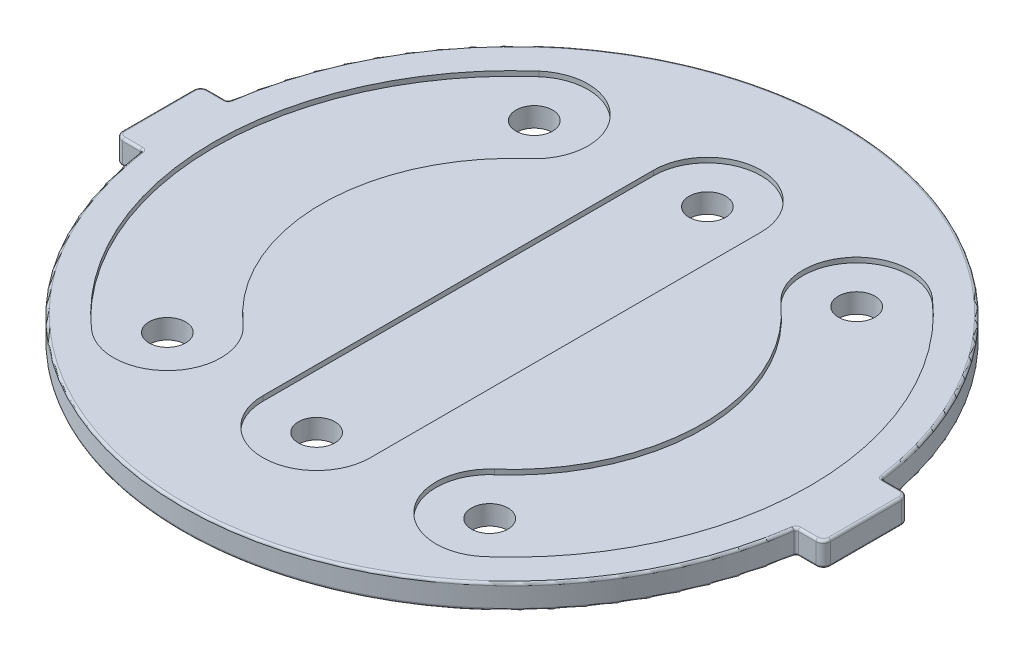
ISO-10303-21;
HEADER;
FILE_DESCRIPTION(('STEP AP214'),'2;1');
FILE_NAME('part.step','',(''),(''),'','','');
FILE_SCHEMA(('AUTOMOTIVE_DESIGN { 1 0 10303 214 1 1 1 1 }'));
ENDSEC;
DATA;
#1=APPLICATION_CONTEXT('core data for automotive mechanical design processes');
#2=APPLICATION_PROTOCOL_DEFINITION('international standard','automotive_design',2000,#1);
#3=PRODUCT_CONTEXT('',#1,'mechanical');
#4=PRODUCT('Part','Part','',(#3));
#5=PRODUCT_RELATED_PRODUCT_CATEGORY('part','',(#4));
#6=PRODUCT_DEFINITION_FORMATION('','',#4);
#7=PRODUCT_DEFINITION_CONTEXT('part definition',#1,'design');
#8=PRODUCT_DEFINITION('design','',#6,#7);
#9=PRODUCT_DEFINITION_SHAPE('','',#8);
#10=(LENGTH_UNIT() NAMED_UNIT(*) SI_UNIT(.MILLI.,.METRE.));
#11=(NAMED_UNIT(*) PLANE_ANGLE_UNIT() SI_UNIT($,.RADIAN.));
#12=(NAMED_UNIT(*) SI_UNIT($,.STERADIAN.) SOLID_ANGLE_UNIT());
#13=UNCERTAINTY_MEASURE_WITH_UNIT(LENGTH_MEASURE(1.E-05),#10,'distance_accuracy_value','');
#14=(GEOMETRIC_REPRESENTATION_CONTEXT(3) GLOBAL_UNCERTAINTY_ASSIGNED_CONTEXT((#13)) GLOBAL_UNIT_ASSIGNED_CONTEXT((#10,
#11,#12)) REPRESENTATION_CONTEXT('',''));
#15=CARTESIAN_POINT('',(0.,0.,0.));
#16=DIRECTION('',(0.,0.,1.));
#17=DIRECTION('',(1.,0.,0.));
#18=AXIS2_PLACEMENT_3D('',#15,#16,#17);
#19=CARTESIAN_POINT('',(65.9983145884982,10.,75.1280405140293));
#20=DIRECTION('',(0.,-1.,0.));
#21=DIRECTION('',(0.,0.,-1.));
#22=AXIS2_PLACEMENT_3D('',#19,#20,#21);
#23=CYLINDRICAL_SURFACE('',#22,7.5);
#24=CARTESIAN_POINT('',(65.9983145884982,0.,75.1280405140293));
#25=DIRECTION('',(0.,1.,0.));
#26=DIRECTION('',(0.,0.,1.));
#27=AXIS2_PLACEMENT_3D('',#24,#25,#26);
#28=CIRCLE('',#27,7.5);
#29=CARTESIAN_POINT('',(65.9983145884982,0.,82.6280405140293));
#30=VERTEX_POINT('',#29);
#31=EDGE_CURVE('E511',#30,#30,#28,.T.);
#32=ORIENTED_EDGE('',*,*,#31,.F.);
#33=EDGE_LOOP('',(#32));
#34=FACE_BOUND('',#33,.T.);
#35=CARTESIAN_POINT('',(65.9983145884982,8.,75.1280405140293));
#36=DIRECTION('',(0.,1.,0.));
#37=DIRECTION('',(0.,0.,1.));
#38=AXIS2_PLACEMENT_3D('',#35,#36,#37);
#39=CIRCLE('',#38,7.5);
#40=CARTESIAN_POINT('',(65.9983145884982,8.,82.6280405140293));
#41=VERTEX_POINT('',#40);
#42=EDGE_CURVE('E424',#41,#41,#39,.T.);
#43=ORIENTED_EDGE('',*,*,#42,.T.);
#44=EDGE_LOOP('',(#43));
#45=FACE_BOUND('',#44,.T.);
#46=ADVANCED_FACE('F104',(#34,#45),#23,.F.);
#47=CARTESIAN_POINT('',(65.9983145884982,10.,-75.1280405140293));
#48=DIRECTION('',(0.,-1.,0.));
#49=DIRECTION('',(0.,0.,-1.));
#50=AXIS2_PLACEMENT_3D('',#47,#48,#49);
#51=CYLINDRICAL_SURFACE('',#50,7.5);
#52=CARTESIAN_POINT('',(65.9983145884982,0.,-75.1280405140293));
#53=DIRECTION('',(0.,1.,0.));
#54=DIRECTION('',(0.,0.,1.));
#55=AXIS2_PLACEMENT_3D('',#52,#53,#54);
#56=CIRCLE('',#55,7.5);
#57=CARTESIAN_POINT('',(65.9983145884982,0.,-67.6280405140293));
#58=VERTEX_POINT('',#57);
#59=EDGE_CURVE('E514',#58,#58,#56,.T.);
#60=ORIENTED_EDGE('',*,*,#59,.F.);
#61=EDGE_LOOP('',(#60));
#62=FACE_BOUND('',#61,.T.);
#63=CARTESIAN_POINT('',(65.9983145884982,8.,-75.1280405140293));
#64=DIRECTION('',(0.,1.,0.));
#65=DIRECTION('',(0.,0.,1.));
#66=AXIS2_PLACEMENT_3D('',#63,#64,#65);
#67=CIRCLE('',#66,7.5);
#68=CARTESIAN_POINT('',(65.9983145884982,8.,-67.6280405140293));
#69=VERTEX_POINT('',#68);
#70=EDGE_CURVE('E108',#69,#69,#67,.T.);
#71=ORIENTED_EDGE('',*,*,#70,.T.);
#72=EDGE_LOOP('',(#71));
#73=FACE_BOUND('',#72,.T.);
#74=ADVANCED_FACE('F1038',(#62,#73),#51,.F.);
#75=CARTESIAN_POINT('',(-65.9983145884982,10.,75.1280405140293));
#76=DIRECTION('',(0.,-1.,0.));
#77=DIRECTION('',(0.,0.,-1.));
#78=AXIS2_PLACEMENT_3D('',#75,#76,#77);
#79=CYLINDRICAL_SURFACE('',#78,7.50000000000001);
#80=CARTESIAN_POINT('',(-65.9983145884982,0.,75.1280405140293));
#81=DIRECTION('',(0.,1.,0.));
#82=DIRECTION('',(0.,0.,1.));
#83=AXIS2_PLACEMENT_3D('',#80,#81,#82);
#84=CIRCLE('',#83,7.50000000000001);
#85=CARTESIAN_POINT('',(-65.9983145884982,0.,82.6280405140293));
#86=VERTEX_POINT('',#85);
#87=EDGE_CURVE('E498',#86,#86,#84,.T.);
#88=ORIENTED_EDGE('',*,*,#87,.F.);
#89=EDGE_LOOP('',(#88));
#90=FACE_BOUND('',#89,.T.);
#91=CARTESIAN_POINT('',(-65.9983145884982,8.,75.1280405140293));
#92=DIRECTION('',(0.,1.,0.));
#93=DIRECTION('',(0.,0.,1.));
#94=AXIS2_PLACEMENT_3D('',#91,#92,#93);
#95=CIRCLE('',#94,7.50000000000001);
#96=CARTESIAN_POINT('',(-65.9983145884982,8.,82.6280405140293));
#97=VERTEX_POINT('',#96);
#98=EDGE_CURVE('E458',#97,#97,#95,.T.);
#99=ORIENTED_EDGE('',*,*,#98,.T.);
#100=EDGE_LOOP('',(#99));
#101=FACE_BOUND('',#100,.T.);
#102=ADVANCED_FACE('F1044',(#90,#101),#79,.F.);
#103=CARTESIAN_POINT('',(-65.9983145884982,10.,-75.1280405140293));
#104=DIRECTION('',(0.,-1.,0.));
#105=DIRECTION('',(0.,0.,-1.));
#106=AXIS2_PLACEMENT_3D('',#103,#104,#105);
#107=CYLINDRICAL_SURFACE('',#106,7.50000000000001);
#108=CARTESIAN_POINT('',(-65.9983145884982,0.,-75.1280405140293));
#109=DIRECTION('',(0.,1.,0.));
#110=DIRECTION('',(0.,0.,1.));
#111=AXIS2_PLACEMENT_3D('',#108,#109,#110);
#112=CIRCLE('',#111,7.50000000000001);
#113=CARTESIAN_POINT('',(-65.9983145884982,0.,-67.6280405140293));
#114=VERTEX_POINT('',#113);
#115=EDGE_CURVE('E501',#114,#114,#112,.T.);
#116=ORIENTED_EDGE('',*,*,#115,.F.);
#117=EDGE_LOOP('',(#116));
#118=FACE_BOUND('',#117,.T.);
#119=CARTESIAN_POINT('',(-65.9983145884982,8.,-75.1280405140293));
#120=DIRECTION('',(0.,1.,0.));
#121=DIRECTION('',(0.,0.,1.));
#122=AXIS2_PLACEMENT_3D('',#119,#120,#121);
#123=CIRCLE('',#122,7.50000000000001);
#124=CARTESIAN_POINT('',(-65.9983145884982,8.,-67.6280405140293));
#125=VERTEX_POINT('',#124);
#126=EDGE_CURVE('E452',#125,#125,#123,.T.);
#127=ORIENTED_EDGE('',*,*,#126,.T.);
#128=EDGE_LOOP('',(#127));
#129=FACE_BOUND('',#128,.T.);
#130=ADVANCED_FACE('F788',(#118,#129),#107,.F.);
#131=CARTESIAN_POINT('',(0.,10.,-80.));
#132=DIRECTION('',(0.,-1.,0.));
#133=DIRECTION('',(0.,0.,-1.));
#134=AXIS2_PLACEMENT_3D('',#131,#132,#133);
#135=CYLINDRICAL_SURFACE('',#134,7.50000000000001);
#136=CARTESIAN_POINT('',(0.,0.,-80.));
#137=DIRECTION('',(0.,1.,0.));
#138=DIRECTION('',(0.,0.,1.));
#139=AXIS2_PLACEMENT_3D('',#136,#137,#138);
#140=CIRCLE('',#139,7.50000000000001);
#141=CARTESIAN_POINT('',(0.,0.,-72.5));
#142=VERTEX_POINT('',#141);
#143=EDGE_CURVE('E505',#142,#142,#140,.T.);
#144=ORIENTED_EDGE('',*,*,#143,.F.);
#145=EDGE_LOOP('',(#144));
#146=FACE_BOUND('',#145,.T.);
#147=CARTESIAN_POINT('',(0.,8.,-80.));
#148=DIRECTION('',(0.,1.,0.));
#149=DIRECTION('',(0.,0.,1.));
#150=AXIS2_PLACEMENT_3D('',#147,#148,#149);
#151=CIRCLE('',#150,7.50000000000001);
#152=CARTESIAN_POINT('',(0.,8.,-72.5));
#153=VERTEX_POINT('',#152);
#154=EDGE_CURVE('E494',#153,#153,#151,.T.);
#155=ORIENTED_EDGE('',*,*,#154,.T.);
#156=EDGE_LOOP('',(#155));
#157=FACE_BOUND('',#156,.T.);
#158=ADVANCED_FACE('F1053',(#146,#157),#135,.F.);
#159=CARTESIAN_POINT('',(0.,10.,80.));
#160=DIRECTION('',(0.,-1.,0.));
#161=DIRECTION('',(0.,0.,-1.));
#162=AXIS2_PLACEMENT_3D('',#159,#160,#161);
#163=CYLINDRICAL_SURFACE('',#162,7.50000000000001);
#164=CARTESIAN_POINT('',(0.,0.,80.));
#165=DIRECTION('',(0.,1.,0.));
#166=DIRECTION('',(0.,0.,1.));
#167=AXIS2_PLACEMENT_3D('',#164,#165,#166);
#168=CIRCLE('',#167,7.50000000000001);
#169=CARTESIAN_POINT('',(0.,0.,87.5));
#170=VERTEX_POINT('',#169);
#171=EDGE_CURVE('E508',#170,#170,#168,.T.);
#172=ORIENTED_EDGE('',*,*,#171,.F.);
#173=EDGE_LOOP('',(#172));
#174=FACE_BOUND('',#173,.T.);
#175=CARTESIAN_POINT('',(0.,8.,80.));
#176=DIRECTION('',(0.,1.,0.));
#177=DIRECTION('',(0.,0.,1.));
#178=AXIS2_PLACEMENT_3D('',#175,#176,#177);
#179=CIRCLE('',#178,7.50000000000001);
#180=CARTESIAN_POINT('',(0.,8.,87.5));
#181=VERTEX_POINT('',#180);
#182=EDGE_CURVE('E487',#181,#181,#179,.T.);
#183=ORIENTED_EDGE('',*,*,#182,.T.);
#184=EDGE_LOOP('',(#183));
#185=FACE_BOUND('',#184,.T.);
#186=ADVANCED_FACE('F1050',(#174,#185),#163,.F.);
#187=CARTESIAN_POINT('',(-297.141421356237,10.,-17.5));
#188=DIRECTION('',(0.,0.,1.));
#189=DIRECTION('',(1.,0.,0.));
#190=AXIS2_PLACEMENT_3D('',#187,#188,#189);
#191=PLANE('',#190);
#192=DIRECTION('',(0.,-1.,0.));
#193=VECTOR('',#192,1.);
#194=CARTESIAN_POINT('',(-142.,10.,-17.5));
#195=LINE('',#194,#193);
#196=CARTESIAN_POINT('',(-142.,0.999999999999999,-17.5));
#197=VERTEX_POINT('',#196);
#198=CARTESIAN_POINT('',(-142.,9.,-17.5));
#199=VERTEX_POINT('',#198);
#200=EDGE_CURVE('E523',#197,#199,#195,.F.);
#201=ORIENTED_EDGE('',*,*,#200,.T.);
#202=DIRECTION('',(-1.,0.,0.));
#203=VECTOR('',#202,1.);
#204=CARTESIAN_POINT('',(-134.735852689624,9.,-17.5));
#205=LINE('',#204,#203);
#206=CARTESIAN_POINT('',(-134.735852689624,9.,-17.5));
#207=VERTEX_POINT('',#206);
#208=EDGE_CURVE('E622',#199,#207,#205,.F.);
#209=ORIENTED_EDGE('',*,*,#208,.T.);
#210=DIRECTION('',(0.,1.,0.));
#211=VECTOR('',#210,1.);
#212=CARTESIAN_POINT('',(-134.735852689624,0.,-17.5));
#213=LINE('',#212,#211);
#214=CARTESIAN_POINT('',(-134.735852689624,0.999999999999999,-17.5));
#215=VERTEX_POINT('',#214);
#216=EDGE_CURVE('E541',#207,#215,#213,.F.);
#217=ORIENTED_EDGE('',*,*,#216,.T.);
#218=DIRECTION('',(-1.,0.,0.));
#219=VECTOR('',#218,1.);
#220=CARTESIAN_POINT('',(-297.141421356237,0.999999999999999,-17.5));
#221=LINE('',#220,#219);
#222=EDGE_CURVE('E620',#215,#197,#221,.T.);
#223=ORIENTED_EDGE('',*,*,#222,.T.);
#224=EDGE_LOOP('',(#201,#209,#217,#223));
#225=FACE_BOUND('',#224,.T.);
#226=ADVANCED_FACE('F1013',(#225),#191,.F.);
#227=CARTESIAN_POINT('',(-145.,10.,0.));
#228=DIRECTION('',(-1.,0.,0.));
#229=DIRECTION('',(0.,0.,1.));
#230=AXIS2_PLACEMENT_3D('',#227,#228,#229);
#231=PLANE('',#230);
#232=DIRECTION('',(0.,-1.,0.));
#233=VECTOR('',#232,1.);
#234=CARTESIAN_POINT('',(-145.,10.,14.5));
#235=LINE('',#234,#233);
#236=CARTESIAN_POINT('',(-145.,0.999999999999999,14.5));
#237=VERTEX_POINT('',#236);
#238=CARTESIAN_POINT('',(-145.,9.,14.5));
#239=VERTEX_POINT('',#238);
#240=EDGE_CURVE('E517',#237,#239,#235,.F.);
#241=ORIENTED_EDGE('',*,*,#240,.T.);
#242=DIRECTION('',(0.,0.,-1.));
#243=VECTOR('',#242,1.);
#244=CARTESIAN_POINT('',(-145.,9.,0.));
#245=LINE('',#244,#243);
#246=CARTESIAN_POINT('',(-145.,9.,-14.5));
#247=VERTEX_POINT('',#246);
#248=EDGE_CURVE('E614',#239,#247,#245,.T.);
#249=ORIENTED_EDGE('',*,*,#248,.T.);
#250=DIRECTION('',(0.,-1.,0.));
#251=VECTOR('',#250,1.);
#252=CARTESIAN_POINT('',(-145.,0.,-14.5));
#253=LINE('',#252,#251);
#254=CARTESIAN_POINT('',(-145.,0.999999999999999,-14.5));
#255=VERTEX_POINT('',#254);
#256=EDGE_CURVE('E520',#247,#255,#253,.T.);
#257=ORIENTED_EDGE('',*,*,#256,.T.);
#258=DIRECTION('',(0.,0.,-1.));
#259=VECTOR('',#258,1.);
#260=CARTESIAN_POINT('',(-145.,1.,14.5));
#261=LINE('',#260,#259);
#262=EDGE_CURVE('E612',#255,#237,#261,.F.);
#263=ORIENTED_EDGE('',*,*,#262,.T.);
#264=EDGE_LOOP('',(#241,#249,#257,#263));
#265=FACE_BOUND('',#264,.T.);
#266=ADVANCED_FACE('F908',(#265),#231,.T.);
#267=CARTESIAN_POINT('',(-297.141421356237,10.,17.5));
#268=DIRECTION('',(0.,0.,1.));
#269=DIRECTION('',(1.,0.,0.));
#270=AXIS2_PLACEMENT_3D('',#267,#268,#269);
#271=PLANE('',#270);
#272=DIRECTION('',(0.,-1.,0.));
#273=VECTOR('',#272,1.);
#274=CARTESIAN_POINT('',(-134.735852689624,10.,17.5));
#275=LINE('',#274,#273);
#276=CARTESIAN_POINT('',(-134.735852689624,0.999999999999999,17.5));
#277=VERTEX_POINT('',#276);
#278=CARTESIAN_POINT('',(-134.735852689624,9.,17.5));
#279=VERTEX_POINT('',#278);
#280=EDGE_CURVE('E556',#277,#279,#275,.F.);
#281=ORIENTED_EDGE('',*,*,#280,.T.);
#282=DIRECTION('',(-1.,0.,0.));
#283=VECTOR('',#282,1.);
#284=CARTESIAN_POINT('',(-297.141421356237,9.,17.5));
#285=LINE('',#284,#283);
#286=CARTESIAN_POINT('',(-142.,9.,17.5));
#287=VERTEX_POINT('',#286);
#288=EDGE_CURVE('E606',#279,#287,#285,.T.);
#289=ORIENTED_EDGE('',*,*,#288,.T.);
#290=DIRECTION('',(0.,-1.,0.));
#291=VECTOR('',#290,1.);
#292=CARTESIAN_POINT('',(-142.,10.,17.5));
#293=LINE('',#292,#291);
#294=CARTESIAN_POINT('',(-142.,0.999999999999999,17.5));
#295=VERTEX_POINT('',#294);
#296=EDGE_CURVE('E526',#287,#295,#293,.T.);
#297=ORIENTED_EDGE('',*,*,#296,.T.);
#298=DIRECTION('',(-1.,0.,0.));
#299=VECTOR('',#298,1.);
#300=CARTESIAN_POINT('',(-134.735852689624,1.,17.5));
#301=LINE('',#300,#299);
#302=EDGE_CURVE('E604',#295,#277,#301,.F.);
#303=ORIENTED_EDGE('',*,*,#302,.T.);
#304=EDGE_LOOP('',(#281,#289,#297,#303));
#305=FACE_BOUND('',#304,.T.);
#306=ADVANCED_FACE('F922',(#305),#271,.T.);
#307=CARTESIAN_POINT('',(-297.141421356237,0.,0.));
#308=DIRECTION('',(0.,1.,0.));
#309=DIRECTION('',(0.,0.,1.));
#310=AXIS2_PLACEMENT_3D('',#307,#308,#309);
#311=PLANE('',#310);
#312=CARTESIAN_POINT('',(0.,0.,0.));
#313=DIRECTION('',(0.,1.,0.));
#314=DIRECTION('',(0.,0.,1.));
#315=AXIS2_PLACEMENT_3D('',#312,#313,#314);
#316=CIRCLE('',#315,134.);
#317=CARTESIAN_POINT('',(132.754443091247,0.,18.2279411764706));
#318=VERTEX_POINT('',#317);
#319=CARTESIAN_POINT('',(-132.754443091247,0.,18.2279411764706));
#320=VERTEX_POINT('',#319);
#321=EDGE_CURVE('E660',#318,#320,#316,.F.);
#322=ORIENTED_EDGE('',*,*,#321,.T.);
#323=CARTESIAN_POINT('',(-134.735852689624,0.,18.5));
#324=DIRECTION('',(0.,1.,0.));
#325=DIRECTION('',(0.,0.,1.));
#326=AXIS2_PLACEMENT_3D('',#323,#324,#325);
#327=CIRCLE('',#326,2.);
#328=CARTESIAN_POINT('',(-134.735852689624,0.,16.5));
#329=VERTEX_POINT('',#328);
#330=EDGE_CURVE('E690',#320,#329,#327,.T.);
#331=ORIENTED_EDGE('',*,*,#330,.T.);
#332=DIRECTION('',(-1.,0.,0.));
#333=VECTOR('',#332,1.);
#334=CARTESIAN_POINT('',(-142.,0.,16.5));
#335=LINE('',#334,#333);
#336=CARTESIAN_POINT('',(-142.,0.,16.5));
#337=VERTEX_POINT('',#336);
#338=EDGE_CURVE('E688',#329,#337,#335,.T.);
#339=ORIENTED_EDGE('',*,*,#338,.T.);
#340=CARTESIAN_POINT('',(-142.,0.,14.5));
#341=DIRECTION('',(0.,1.,0.));
#342=DIRECTION('',(0.,0.,1.));
#343=AXIS2_PLACEMENT_3D('',#340,#341,#342);
#344=CIRCLE('',#343,2.);
#345=CARTESIAN_POINT('',(-144.,0.,14.5));
#346=VERTEX_POINT('',#345);
#347=EDGE_CURVE('E686',#337,#346,#344,.F.);
#348=ORIENTED_EDGE('',*,*,#347,.T.);
#349=DIRECTION('',(0.,0.,-1.));
#350=VECTOR('',#349,1.);
#351=CARTESIAN_POINT('',(-144.,0.,-14.5));
#352=LINE('',#351,#350);
#353=CARTESIAN_POINT('',(-144.,0.,-14.5));
#354=VERTEX_POINT('',#353);
#355=EDGE_CURVE('E684',#346,#354,#352,.T.);
#356=ORIENTED_EDGE('',*,*,#355,.T.);
#357=CARTESIAN_POINT('',(-142.,0.,-14.5));
#358=DIRECTION('',(0.,1.,0.));
#359=DIRECTION('',(0.,0.,1.));
#360=AXIS2_PLACEMENT_3D('',#357,#358,#359);
#361=CIRCLE('',#360,2.);
#362=CARTESIAN_POINT('',(-142.,0.,-16.5));
#363=VERTEX_POINT('',#362);
#364=EDGE_CURVE('E682',#354,#363,#361,.F.);
#365=ORIENTED_EDGE('',*,*,#364,.T.);
#366=DIRECTION('',(-1.,0.,0.));
#367=VECTOR('',#366,1.);
#368=CARTESIAN_POINT('',(-297.141421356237,0.,-16.5));
#369=LINE('',#368,#367);
#370=CARTESIAN_POINT('',(-134.735852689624,0.,-16.5));
#371=VERTEX_POINT('',#370);
#372=EDGE_CURVE('E680',#363,#371,#369,.F.);
#373=ORIENTED_EDGE('',*,*,#372,.T.);
#374=CARTESIAN_POINT('',(-134.735852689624,0.,-18.5));
#375=DIRECTION('',(0.,1.,0.));
#376=DIRECTION('',(0.,0.,1.));
#377=AXIS2_PLACEMENT_3D('',#374,#375,#376);
#378=CIRCLE('',#377,2.);
#379=CARTESIAN_POINT('',(-132.754443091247,0.,-18.2279411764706));
#380=VERTEX_POINT('',#379);
#381=EDGE_CURVE('E678',#371,#380,#378,.T.);
#382=ORIENTED_EDGE('',*,*,#381,.T.);
#383=CARTESIAN_POINT('',(0.,0.,0.));
#384=DIRECTION('',(0.,1.,0.));
#385=DIRECTION('',(0.,0.,1.));
#386=AXIS2_PLACEMENT_3D('',#383,#384,#385);
#387=CIRCLE('',#386,134.);
#388=CARTESIAN_POINT('',(132.754443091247,0.,-18.2279411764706));
#389=VERTEX_POINT('',#388);
#390=EDGE_CURVE('E676',#380,#389,#387,.F.);
#391=ORIENTED_EDGE('',*,*,#390,.T.);
#392=CARTESIAN_POINT('',(134.735852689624,0.,-18.5));
#393=DIRECTION('',(0.,1.,0.));
#394=DIRECTION('',(0.,0.,1.));
#395=AXIS2_PLACEMENT_3D('',#392,#393,#394);
#396=CIRCLE('',#395,2.);
#397=CARTESIAN_POINT('',(134.735852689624,0.,-16.5));
#398=VERTEX_POINT('',#397);
#399=EDGE_CURVE('E674',#389,#398,#396,.T.);
#400=ORIENTED_EDGE('',*,*,#399,.T.);
#401=DIRECTION('',(-1.,0.,0.));
#402=VECTOR('',#401,1.);
#403=CARTESIAN_POINT('',(-297.141421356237,0.,-16.5));
#404=LINE('',#403,#402);
#405=CARTESIAN_POINT('',(142.,0.,-16.5));
#406=VERTEX_POINT('',#405);
#407=EDGE_CURVE('E672',#398,#406,#404,.F.);
#408=ORIENTED_EDGE('',*,*,#407,.T.);
#409=CARTESIAN_POINT('',(142.,0.,-14.5));
#410=DIRECTION('',(0.,1.,0.));
#411=DIRECTION('',(0.,0.,1.));
#412=AXIS2_PLACEMENT_3D('',#409,#410,#411);
#413=CIRCLE('',#412,2.);
#414=CARTESIAN_POINT('',(144.,0.,-14.5));
#415=VERTEX_POINT('',#414);
#416=EDGE_CURVE('E670',#406,#415,#413,.F.);
#417=ORIENTED_EDGE('',*,*,#416,.T.);
#418=DIRECTION('',(0.,0.,-1.));
#419=VECTOR('',#418,1.);
#420=CARTESIAN_POINT('',(144.,0.,0.));
#421=LINE('',#420,#419);
#422=CARTESIAN_POINT('',(144.,0.,14.5));
#423=VERTEX_POINT('',#422);
#424=EDGE_CURVE('E668',#415,#423,#421,.F.);
#425=ORIENTED_EDGE('',*,*,#424,.T.);
#426=CARTESIAN_POINT('',(142.,0.,14.5));
#427=DIRECTION('',(0.,1.,0.));
#428=DIRECTION('',(0.,0.,1.));
#429=AXIS2_PLACEMENT_3D('',#426,#427,#428);
#430=CIRCLE('',#429,2.);
#431=CARTESIAN_POINT('',(142.,0.,16.5));
#432=VERTEX_POINT('',#431);
#433=EDGE_CURVE('E666',#423,#432,#430,.F.);
#434=ORIENTED_EDGE('',*,*,#433,.T.);
#435=DIRECTION('',(-1.,0.,0.));
#436=VECTOR('',#435,1.);
#437=CARTESIAN_POINT('',(134.735852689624,0.,16.5));
#438=LINE('',#437,#436);
#439=CARTESIAN_POINT('',(134.735852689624,0.,16.5));
#440=VERTEX_POINT('',#439);
#441=EDGE_CURVE('E664',#432,#440,#438,.T.);
#442=ORIENTED_EDGE('',*,*,#441,.T.);
#443=CARTESIAN_POINT('',(134.735852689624,0.,18.5));
#444=DIRECTION('',(0.,1.,0.));
#445=DIRECTION('',(0.,0.,1.));
#446=AXIS2_PLACEMENT_3D('',#443,#444,#445);
#447=CIRCLE('',#446,2.);
#448=EDGE_CURVE('E662',#440,#318,#447,.T.);
#449=ORIENTED_EDGE('',*,*,#448,.T.);
#450=EDGE_LOOP('',(#322,#331,#339,#348,#356,#365,#373,#382,#391,#400,#408,#417,#425,#434,#442,#449));
#451=FACE_BOUND('',#450,.T.);
#452=ORIENTED_EDGE('',*,*,#115,.T.);
#453=EDGE_LOOP('',(#452));
#454=FACE_BOUND('',#453,.T.);
#455=ORIENTED_EDGE('',*,*,#171,.T.);
#456=EDGE_LOOP('',(#455));
#457=FACE_BOUND('',#456,.T.);
#458=ORIENTED_EDGE('',*,*,#59,.T.);
#459=EDGE_LOOP('',(#458));
#460=FACE_BOUND('',#459,.T.);
#461=ORIENTED_EDGE('',*,*,#31,.T.);
#462=EDGE_LOOP('',(#461));
#463=FACE_BOUND('',#462,.T.);
#464=ORIENTED_EDGE('',*,*,#143,.T.);
#465=EDGE_LOOP('',(#464));
#466=FACE_BOUND('',#465,.T.);
#467=ORIENTED_EDGE('',*,*,#87,.T.);
#468=EDGE_LOOP('',(#467));
#469=FACE_BOUND('',#468,.T.);
#470=ADVANCED_FACE('F814',(#451,#454,#457,#460,#463,#466,#469),#311,.F.);
#471=CARTESIAN_POINT('',(-297.141421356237,10.,0.));
#472=DIRECTION('',(0.,1.,0.));
#473=DIRECTION('',(0.,0.,1.));
#474=AXIS2_PLACEMENT_3D('',#471,#472,#473);
#475=PLANE('',#474);
#476=CARTESIAN_POINT('',(65.9983145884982,10.,75.1280405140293));
#477=DIRECTION('',(0.,1.,0.));
#478=DIRECTION('',(0.,0.,1.));
#479=AXIS2_PLACEMENT_3D('',#476,#477,#478);
#480=CIRCLE('',#479,22.);
#481=CARTESIAN_POINT('',(51.4786853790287,10.,58.5998716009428));
#482=VERTEX_POINT('',#481);
#483=CARTESIAN_POINT('',(80.5179437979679,10.,91.6562094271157));
#484=VERTEX_POINT('',#483);
#485=EDGE_CURVE('E121',#482,#484,#480,.T.);
#486=ORIENTED_EDGE('',*,*,#485,.F.);
#487=CARTESIAN_POINT('',(0.,10.,0.));
#488=DIRECTION('',(0.,-1.,0.));
#489=DIRECTION('',(0.,0.,1.));
#490=AXIS2_PLACEMENT_3D('',#487,#488,#489);
#491=CIRCLE('',#490,78.);
#492=CARTESIAN_POINT('',(51.4786853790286,10.,-58.5998716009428));
#493=VERTEX_POINT('',#492);
#494=EDGE_CURVE('E406',#493,#482,#491,.T.);
#495=ORIENTED_EDGE('',*,*,#494,.F.);
#496=CARTESIAN_POINT('',(65.9983145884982,10.,-75.1280405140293));
#497=DIRECTION('',(0.,1.,0.));
#498=DIRECTION('',(0.,0.,1.));
#499=AXIS2_PLACEMENT_3D('',#496,#497,#498);
#500=CIRCLE('',#499,22.);
#501=CARTESIAN_POINT('',(80.5179437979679,10.,-91.6562094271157));
#502=VERTEX_POINT('',#501);
#503=EDGE_CURVE('E409',#502,#493,#500,.T.);
#504=ORIENTED_EDGE('',*,*,#503,.F.);
#505=CARTESIAN_POINT('',(0.,10.,0.));
#506=DIRECTION('',(0.,1.,0.));
#507=DIRECTION('',(0.,0.,1.));
#508=AXIS2_PLACEMENT_3D('',#505,#506,#507);
#509=CIRCLE('',#508,122.);
#510=EDGE_CURVE('E415',#484,#502,#509,.T.);
#511=ORIENTED_EDGE('',*,*,#510,.F.);
#512=EDGE_LOOP('',(#486,#495,#504,#511));
#513=FACE_BOUND('',#512,.T.);
#514=CARTESIAN_POINT('',(-65.9983145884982,10.,-75.1280405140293));
#515=DIRECTION('',(0.,1.,0.));
#516=DIRECTION('',(0.,0.,1.));
#517=AXIS2_PLACEMENT_3D('',#514,#515,#516);
#518=CIRCLE('',#517,22.);
#519=CARTESIAN_POINT('',(-51.4786853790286,10.,-58.5998716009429));
#520=VERTEX_POINT('',#519);
#521=CARTESIAN_POINT('',(-80.5179437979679,10.,-91.6562094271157));
#522=VERTEX_POINT('',#521);
#523=EDGE_CURVE('E129',#520,#522,#518,.T.);
#524=ORIENTED_EDGE('',*,*,#523,.F.);
#525=CARTESIAN_POINT('',(0.,10.,0.));
#526=DIRECTION('',(0.,-1.,0.));
#527=DIRECTION('',(0.,0.,1.));
#528=AXIS2_PLACEMENT_3D('',#525,#526,#527);
#529=CIRCLE('',#528,78.);
#530=CARTESIAN_POINT('',(-51.4786853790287,10.,58.5998716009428));
#531=VERTEX_POINT('',#530);
#532=EDGE_CURVE('E431',#531,#520,#529,.T.);
#533=ORIENTED_EDGE('',*,*,#532,.F.);
#534=CARTESIAN_POINT('',(-65.9983145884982,10.,75.1280405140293));
#535=DIRECTION('',(0.,1.,0.));
#536=DIRECTION('',(0.,0.,1.));
#537=AXIS2_PLACEMENT_3D('',#534,#535,#536);
#538=CIRCLE('',#537,22.);
#539=CARTESIAN_POINT('',(-80.5179437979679,10.,91.6562094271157));
#540=VERTEX_POINT('',#539);
#541=EDGE_CURVE('E445',#540,#531,#538,.T.);
#542=ORIENTED_EDGE('',*,*,#541,.F.);
#543=CARTESIAN_POINT('',(0.,10.,0.));
#544=DIRECTION('',(0.,1.,0.));
#545=DIRECTION('',(0.,0.,1.));
#546=AXIS2_PLACEMENT_3D('',#543,#544,#545);
#547=CIRCLE('',#546,122.);
#548=EDGE_CURVE('E442',#522,#540,#547,.T.);
#549=ORIENTED_EDGE('',*,*,#548,.F.);
#550=EDGE_LOOP('',(#524,#533,#542,#549));
#551=FACE_BOUND('',#550,.T.);
#552=CARTESIAN_POINT('',(0.,10.,-80.));
#553=DIRECTION('',(0.,1.,0.));
#554=DIRECTION('',(0.,0.,1.));
#555=AXIS2_PLACEMENT_3D('',#552,#553,#554);
#556=CIRCLE('',#555,22.);
#557=CARTESIAN_POINT('',(22.,10.,-80.));
#558=VERTEX_POINT('',#557);
#559=CARTESIAN_POINT('',(-22.,10.,-80.));
#560=VERTEX_POINT('',#559);
#561=EDGE_CURVE('E461',#558,#560,#556,.T.);
#562=ORIENTED_EDGE('',*,*,#561,.F.);
#563=DIRECTION('',(0.,0.,-1.));
#564=VECTOR('',#563,1.);
#565=CARTESIAN_POINT('',(22.,10.,80.));
#566=LINE('',#565,#564);
#567=CARTESIAN_POINT('',(22.,10.,80.));
#568=VERTEX_POINT('',#567);
#569=EDGE_CURVE('E466',#568,#558,#566,.T.);
#570=ORIENTED_EDGE('',*,*,#569,.F.);
#571=CARTESIAN_POINT('',(0.,10.,80.));
#572=DIRECTION('',(0.,1.,0.));
#573=DIRECTION('',(0.,0.,1.));
#574=AXIS2_PLACEMENT_3D('',#571,#572,#573);
#575=CIRCLE('',#574,22.);
#576=CARTESIAN_POINT('',(-22.,10.,80.));
#577=VERTEX_POINT('',#576);
#578=EDGE_CURVE('E480',#577,#568,#575,.T.);
#579=ORIENTED_EDGE('',*,*,#578,.F.);
#580=DIRECTION('',(0.,0.,1.));
#581=VECTOR('',#580,1.);
#582=CARTESIAN_POINT('',(-22.,10.,-80.));
#583=LINE('',#582,#581);
#584=EDGE_CURVE('E477',#560,#577,#583,.T.);
#585=ORIENTED_EDGE('',*,*,#584,.F.);
#586=EDGE_LOOP('',(#562,#570,#579,#585));
#587=FACE_BOUND('',#586,.T.);
#588=DIRECTION('',(-1.,0.,0.));
#589=VECTOR('',#588,1.);
#590=CARTESIAN_POINT('',(-297.141421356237,10.,16.5));
#591=LINE('',#590,#589);
#592=CARTESIAN_POINT('',(-142.,10.,16.5));
#593=VERTEX_POINT('',#592);
#594=CARTESIAN_POINT('',(-134.735852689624,10.,16.5));
#595=VERTEX_POINT('',#594);
#596=EDGE_CURVE('E593',#593,#595,#591,.F.);
#597=ORIENTED_EDGE('',*,*,#596,.T.);
#598=CARTESIAN_POINT('',(-134.735852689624,10.,18.5));
#599=DIRECTION('',(0.,1.,0.));
#600=DIRECTION('',(0.,0.,1.));
#601=AXIS2_PLACEMENT_3D('',#598,#599,#600);
#602=CIRCLE('',#601,2.);
#603=CARTESIAN_POINT('',(-132.754443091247,10.,18.2279411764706));
#604=VERTEX_POINT('',#603);
#605=EDGE_CURVE('E595',#595,#604,#602,.F.);
#606=ORIENTED_EDGE('',*,*,#605,.T.);
#607=CARTESIAN_POINT('',(0.,10.,0.));
#608=DIRECTION('',(0.,1.,0.));
#609=DIRECTION('',(0.,0.,1.));
#610=AXIS2_PLACEMENT_3D('',#607,#608,#609);
#611=CIRCLE('',#610,134.);
#612=CARTESIAN_POINT('',(132.754443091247,10.,18.2279411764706));
#613=VERTEX_POINT('',#612);
#614=EDGE_CURVE('E565',#604,#613,#611,.T.);
#615=ORIENTED_EDGE('',*,*,#614,.T.);
#616=CARTESIAN_POINT('',(134.735852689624,10.,18.5));
#617=DIRECTION('',(0.,1.,0.));
#618=DIRECTION('',(0.,0.,1.));
#619=AXIS2_PLACEMENT_3D('',#616,#617,#618);
#620=CIRCLE('',#619,2.);
#621=CARTESIAN_POINT('',(134.735852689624,10.,16.5));
#622=VERTEX_POINT('',#621);
#623=EDGE_CURVE('E567',#613,#622,#620,.F.);
#624=ORIENTED_EDGE('',*,*,#623,.T.);
#625=DIRECTION('',(-1.,0.,0.));
#626=VECTOR('',#625,1.);
#627=CARTESIAN_POINT('',(-297.141421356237,10.,16.5));
#628=LINE('',#627,#626);
#629=CARTESIAN_POINT('',(142.,10.,16.5));
#630=VERTEX_POINT('',#629);
#631=EDGE_CURVE('E569',#622,#630,#628,.F.);
#632=ORIENTED_EDGE('',*,*,#631,.T.);
#633=CARTESIAN_POINT('',(142.,10.,14.5));
#634=DIRECTION('',(0.,1.,0.));
#635=DIRECTION('',(0.,0.,1.));
#636=AXIS2_PLACEMENT_3D('',#633,#634,#635);
#637=CIRCLE('',#636,2.);
#638=CARTESIAN_POINT('',(144.,10.,14.5));
#639=VERTEX_POINT('',#638);
#640=EDGE_CURVE('E571',#630,#639,#637,.T.);
#641=ORIENTED_EDGE('',*,*,#640,.T.);
#642=DIRECTION('',(0.,0.,-1.));
#643=VECTOR('',#642,1.);
#644=CARTESIAN_POINT('',(144.,10.,-14.5));
#645=LINE('',#644,#643);
#646=CARTESIAN_POINT('',(144.,10.,-14.5));
#647=VERTEX_POINT('',#646);
#648=EDGE_CURVE('E573',#639,#647,#645,.T.);
#649=ORIENTED_EDGE('',*,*,#648,.T.);
#650=CARTESIAN_POINT('',(142.,10.,-14.5));
#651=DIRECTION('',(0.,1.,0.));
#652=DIRECTION('',(0.,0.,1.));
#653=AXIS2_PLACEMENT_3D('',#650,#651,#652);
#654=CIRCLE('',#653,2.);
#655=CARTESIAN_POINT('',(142.,10.,-16.5));
#656=VERTEX_POINT('',#655);
#657=EDGE_CURVE('E575',#647,#656,#654,.T.);
#658=ORIENTED_EDGE('',*,*,#657,.T.);
#659=DIRECTION('',(-1.,0.,0.));
#660=VECTOR('',#659,1.);
#661=CARTESIAN_POINT('',(134.735852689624,10.,-16.5));
#662=LINE('',#661,#660);
#663=CARTESIAN_POINT('',(134.735852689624,10.,-16.5));
#664=VERTEX_POINT('',#663);
#665=EDGE_CURVE('E577',#656,#664,#662,.T.);
#666=ORIENTED_EDGE('',*,*,#665,.T.);
#667=CARTESIAN_POINT('',(134.735852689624,10.,-18.5));
#668=DIRECTION('',(0.,1.,0.));
#669=DIRECTION('',(0.,0.,1.));
#670=AXIS2_PLACEMENT_3D('',#667,#668,#669);
#671=CIRCLE('',#670,2.);
#672=CARTESIAN_POINT('',(132.754443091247,10.,-18.2279411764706));
#673=VERTEX_POINT('',#672);
#674=EDGE_CURVE('E579',#664,#673,#671,.F.);
#675=ORIENTED_EDGE('',*,*,#674,.T.);
#676=CARTESIAN_POINT('',(0.,10.,0.));
#677=DIRECTION('',(0.,1.,0.));
#678=DIRECTION('',(0.,0.,1.));
#679=AXIS2_PLACEMENT_3D('',#676,#677,#678);
#680=CIRCLE('',#679,134.);
#681=CARTESIAN_POINT('',(-132.754443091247,10.,-18.2279411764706));
#682=VERTEX_POINT('',#681);
#683=EDGE_CURVE('E581',#673,#682,#680,.T.);
#684=ORIENTED_EDGE('',*,*,#683,.T.);
#685=CARTESIAN_POINT('',(-134.735852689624,10.,-18.5));
#686=DIRECTION('',(0.,1.,0.));
#687=DIRECTION('',(0.,0.,1.));
#688=AXIS2_PLACEMENT_3D('',#685,#686,#687);
#689=CIRCLE('',#688,2.);
#690=CARTESIAN_POINT('',(-134.735852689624,10.,-16.5));
#691=VERTEX_POINT('',#690);
#692=EDGE_CURVE('E583',#682,#691,#689,.F.);
#693=ORIENTED_EDGE('',*,*,#692,.T.);
#694=DIRECTION('',(-1.,0.,0.));
#695=VECTOR('',#694,1.);
#696=CARTESIAN_POINT('',(-142.,10.,-16.5));
#697=LINE('',#696,#695);
#698=CARTESIAN_POINT('',(-142.,10.,-16.5));
#699=VERTEX_POINT('',#698);
#700=EDGE_CURVE('E585',#691,#699,#697,.T.);
#701=ORIENTED_EDGE('',*,*,#700,.T.);
#702=CARTESIAN_POINT('',(-142.,10.,-14.5));
#703=DIRECTION('',(0.,1.,0.));
#704=DIRECTION('',(0.,0.,1.));
#705=AXIS2_PLACEMENT_3D('',#702,#703,#704);
#706=CIRCLE('',#705,2.);
#707=CARTESIAN_POINT('',(-144.,10.,-14.5));
#708=VERTEX_POINT('',#707);
#709=EDGE_CURVE('E587',#699,#708,#706,.T.);
#710=ORIENTED_EDGE('',*,*,#709,.T.);
#711=DIRECTION('',(0.,0.,-1.));
#712=VECTOR('',#711,1.);
#713=CARTESIAN_POINT('',(-144.,10.,0.));
#714=LINE('',#713,#712);
#715=CARTESIAN_POINT('',(-144.,10.,14.5));
#716=VERTEX_POINT('',#715);
#717=EDGE_CURVE('E589',#708,#716,#714,.F.);
#718=ORIENTED_EDGE('',*,*,#717,.T.);
#719=CARTESIAN_POINT('',(-142.,10.,14.5));
#720=DIRECTION('',(0.,1.,0.));
#721=DIRECTION('',(0.,0.,1.));
#722=AXIS2_PLACEMENT_3D('',#719,#720,#721);
#723=CIRCLE('',#722,2.);
#724=EDGE_CURVE('E591',#716,#593,#723,.T.);
#725=ORIENTED_EDGE('',*,*,#724,.T.);
#726=EDGE_LOOP('',(#597,#606,#615,#624,#632,#641,#649,#658,#666,#675,#684,#693,#701,#710,#718,#725));
#727=FACE_BOUND('',#726,.T.);
#728=ADVANCED_FACE('F810',(#513,#551,#587,#727),#475,.T.);
#729=CARTESIAN_POINT('',(145.,10.,0.));
#730=DIRECTION('',(-1.,0.,0.));
#731=DIRECTION('',(0.,0.,1.));
#732=AXIS2_PLACEMENT_3D('',#729,#730,#731);
#733=PLANE('',#732);
#734=DIRECTION('',(0.,-1.,0.));
#735=VECTOR('',#734,1.);
#736=CARTESIAN_POINT('',(145.,10.,-14.5));
#737=LINE('',#736,#735);
#738=CARTESIAN_POINT('',(145.,0.999999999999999,-14.5));
#739=VERTEX_POINT('',#738);
#740=CARTESIAN_POINT('',(145.,9.,-14.5));
#741=VERTEX_POINT('',#740);
#742=EDGE_CURVE('E535',#739,#741,#737,.F.);
#743=ORIENTED_EDGE('',*,*,#742,.T.);
#744=DIRECTION('',(0.,0.,-1.));
#745=VECTOR('',#744,1.);
#746=CARTESIAN_POINT('',(145.,9.,14.5));
#747=LINE('',#746,#745);
#748=CARTESIAN_POINT('',(145.,9.,14.5));
#749=VERTEX_POINT('',#748);
#750=EDGE_CURVE('E646',#741,#749,#747,.F.);
#751=ORIENTED_EDGE('',*,*,#750,.T.);
#752=DIRECTION('',(0.,-1.,0.));
#753=VECTOR('',#752,1.);
#754=CARTESIAN_POINT('',(145.,0.,14.5));
#755=LINE('',#754,#753);
#756=CARTESIAN_POINT('',(145.,0.999999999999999,14.5));
#757=VERTEX_POINT('',#756);
#758=EDGE_CURVE('E532',#749,#757,#755,.T.);
#759=ORIENTED_EDGE('',*,*,#758,.T.);
#760=DIRECTION('',(0.,0.,-1.));
#761=VECTOR('',#760,1.);
#762=CARTESIAN_POINT('',(145.,0.999999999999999,0.));
#763=LINE('',#762,#761);
#764=EDGE_CURVE('E644',#757,#739,#763,.T.);
#765=ORIENTED_EDGE('',*,*,#764,.T.);
#766=EDGE_LOOP('',(#743,#751,#759,#765));
#767=FACE_BOUND('',#766,.T.);
#768=ADVANCED_FACE('F813',(#767),#733,.F.);
#769=CARTESIAN_POINT('',(-297.141421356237,10.,-17.5));
#770=DIRECTION('',(0.,0.,1.));
#771=DIRECTION('',(1.,0.,0.));
#772=AXIS2_PLACEMENT_3D('',#769,#770,#771);
#773=PLANE('',#772);
#774=DIRECTION('',(0.,1.,0.));
#775=VECTOR('',#774,1.);
#776=CARTESIAN_POINT('',(134.735852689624,10.,-17.5));
#777=LINE('',#776,#775);
#778=CARTESIAN_POINT('',(134.735852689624,0.999999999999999,-17.5));
#779=VERTEX_POINT('',#778);
#780=CARTESIAN_POINT('',(134.735852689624,9.,-17.5));
#781=VERTEX_POINT('',#780);
#782=EDGE_CURVE('E559',#779,#781,#777,.T.);
#783=ORIENTED_EDGE('',*,*,#782,.T.);
#784=DIRECTION('',(-1.,0.,0.));
#785=VECTOR('',#784,1.);
#786=CARTESIAN_POINT('',(142.,9.,-17.5));
#787=LINE('',#786,#785);
#788=CARTESIAN_POINT('',(142.,9.,-17.5));
#789=VERTEX_POINT('',#788);
#790=EDGE_CURVE('E638',#781,#789,#787,.F.);
#791=ORIENTED_EDGE('',*,*,#790,.T.);
#792=DIRECTION('',(0.,-1.,0.));
#793=VECTOR('',#792,1.);
#794=CARTESIAN_POINT('',(142.,10.,-17.5));
#795=LINE('',#794,#793);
#796=CARTESIAN_POINT('',(142.,0.999999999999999,-17.5));
#797=VERTEX_POINT('',#796);
#798=EDGE_CURVE('E529',#789,#797,#795,.T.);
#799=ORIENTED_EDGE('',*,*,#798,.T.);
#800=DIRECTION('',(-1.,0.,0.));
#801=VECTOR('',#800,1.);
#802=CARTESIAN_POINT('',(-297.141421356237,0.999999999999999,-17.5));
#803=LINE('',#802,#801);
#804=EDGE_CURVE('E636',#797,#779,#803,.T.);
#805=ORIENTED_EDGE('',*,*,#804,.T.);
#806=EDGE_LOOP('',(#783,#791,#799,#805));
#807=FACE_BOUND('',#806,.T.);
#808=ADVANCED_FACE('F992',(#807),#773,.F.);
#809=CARTESIAN_POINT('',(-297.141421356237,10.,17.5));
#810=DIRECTION('',(0.,0.,1.));
#811=DIRECTION('',(1.,0.,0.));
#812=AXIS2_PLACEMENT_3D('',#809,#810,#811);
#813=PLANE('',#812);
#814=DIRECTION('',(0.,-1.,0.));
#815=VECTOR('',#814,1.);
#816=CARTESIAN_POINT('',(142.,10.,17.5));
#817=LINE('',#816,#815);
#818=CARTESIAN_POINT('',(142.,0.999999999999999,17.5));
#819=VERTEX_POINT('',#818);
#820=CARTESIAN_POINT('',(142.,9.,17.5));
#821=VERTEX_POINT('',#820);
#822=EDGE_CURVE('E538',#819,#821,#817,.F.);
#823=ORIENTED_EDGE('',*,*,#822,.T.);
#824=DIRECTION('',(-1.,0.,0.));
#825=VECTOR('',#824,1.);
#826=CARTESIAN_POINT('',(-297.141421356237,9.,17.5));
#827=LINE('',#826,#825);
#828=CARTESIAN_POINT('',(134.735852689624,9.,17.5));
#829=VERTEX_POINT('',#828);
#830=EDGE_CURVE('E654',#821,#829,#827,.T.);
#831=ORIENTED_EDGE('',*,*,#830,.T.);
#832=DIRECTION('',(0.,-1.,0.));
#833=VECTOR('',#832,1.);
#834=CARTESIAN_POINT('',(134.735852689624,10.,17.5));
#835=LINE('',#834,#833);
#836=CARTESIAN_POINT('',(134.735852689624,0.999999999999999,17.5));
#837=VERTEX_POINT('',#836);
#838=EDGE_CURVE('E562',#829,#837,#835,.T.);
#839=ORIENTED_EDGE('',*,*,#838,.T.);
#840=DIRECTION('',(-1.,0.,0.));
#841=VECTOR('',#840,1.);
#842=CARTESIAN_POINT('',(142.,1.,17.5));
#843=LINE('',#842,#841);
#844=EDGE_CURVE('E652',#837,#819,#843,.F.);
#845=ORIENTED_EDGE('',*,*,#844,.T.);
#846=EDGE_LOOP('',(#823,#831,#839,#845));
#847=FACE_BOUND('',#846,.T.);
#848=ADVANCED_FACE('F961',(#847),#813,.T.);
#849=CARTESIAN_POINT('',(0.,10.,0.));
#850=DIRECTION('',(0.,-1.,0.));
#851=DIRECTION('',(0.,0.,-1.));
#852=AXIS2_PLACEMENT_3D('',#849,#850,#851);
#853=CYLINDRICAL_SURFACE('',#852,135.);
#854=DIRECTION('',(0.,-1.,0.));
#855=VECTOR('',#854,1.);
#856=CARTESIAN_POINT('',(-133.745147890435,10.,-18.3639705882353));
#857=LINE('',#856,#855);
#858=CARTESIAN_POINT('',(-133.745147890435,0.999999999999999,-18.3639705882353));
#859=VERTEX_POINT('',#858);
#860=CARTESIAN_POINT('',(-133.745147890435,9.,-18.3639705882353));
#861=VERTEX_POINT('',#860);
#862=EDGE_CURVE('E547',#859,#861,#857,.F.);
#863=ORIENTED_EDGE('',*,*,#862,.T.);
#864=CARTESIAN_POINT('',(0.,9.,0.));
#865=DIRECTION('',(0.,1.,0.));
#866=DIRECTION('',(0.,0.,1.));
#867=AXIS2_PLACEMENT_3D('',#864,#865,#866);
#868=CIRCLE('',#867,135.);
#869=CARTESIAN_POINT('',(133.745147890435,9.,-18.3639705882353));
#870=VERTEX_POINT('',#869);
#871=EDGE_CURVE('E630',#861,#870,#868,.F.);
#872=ORIENTED_EDGE('',*,*,#871,.T.);
#873=DIRECTION('',(0.,-1.,0.));
#874=VECTOR('',#873,1.);
#875=CARTESIAN_POINT('',(133.745147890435,10.,-18.3639705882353));
#876=LINE('',#875,#874);
#877=CARTESIAN_POINT('',(133.745147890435,0.999999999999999,-18.3639705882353));
#878=VERTEX_POINT('',#877);
#879=EDGE_CURVE('E544',#870,#878,#876,.T.);
#880=ORIENTED_EDGE('',*,*,#879,.T.);
#881=CARTESIAN_POINT('',(0.,0.999999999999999,0.));
#882=DIRECTION('',(0.,1.,0.));
#883=DIRECTION('',(0.,0.,1.));
#884=AXIS2_PLACEMENT_3D('',#881,#882,#883);
#885=CIRCLE('',#884,135.);
#886=EDGE_CURVE('E628',#878,#859,#885,.T.);
#887=ORIENTED_EDGE('',*,*,#886,.T.);
#888=EDGE_LOOP('',(#863,#872,#880,#887));
#889=FACE_BOUND('',#888,.T.);
#890=ADVANCED_FACE('F817',(#889),#853,.T.);
#891=DIRECTION('',(0.,-1.,0.));
#892=VECTOR('',#891,1.);
#893=CARTESIAN_POINT('',(133.745147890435,10.,18.3639705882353));
#894=LINE('',#893,#892);
#895=CARTESIAN_POINT('',(133.745147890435,0.999999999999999,18.3639705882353));
#896=VERTEX_POINT('',#895);
#897=CARTESIAN_POINT('',(133.745147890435,9.,18.3639705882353));
#898=VERTEX_POINT('',#897);
#899=EDGE_CURVE('E550',#896,#898,#894,.F.);
#900=ORIENTED_EDGE('',*,*,#899,.T.);
#901=CARTESIAN_POINT('',(0.,9.,0.));
#902=DIRECTION('',(0.,1.,0.));
#903=DIRECTION('',(0.,0.,1.));
#904=AXIS2_PLACEMENT_3D('',#901,#902,#903);
#905=CIRCLE('',#904,135.);
#906=CARTESIAN_POINT('',(-133.745147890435,9.,18.3639705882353));
#907=VERTEX_POINT('',#906);
#908=EDGE_CURVE('E12',#898,#907,#905,.F.);
#909=ORIENTED_EDGE('',*,*,#908,.T.);
#910=DIRECTION('',(0.,-1.,0.));
#911=VECTOR('',#910,1.);
#912=CARTESIAN_POINT('',(-133.745147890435,10.,18.3639705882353));
#913=LINE('',#912,#911);
#914=CARTESIAN_POINT('',(-133.745147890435,0.999999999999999,18.3639705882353));
#915=VERTEX_POINT('',#914);
#916=EDGE_CURVE('E553',#907,#915,#913,.T.);
#917=ORIENTED_EDGE('',*,*,#916,.T.);
#918=CARTESIAN_POINT('',(0.,0.999999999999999,0.));
#919=DIRECTION('',(0.,1.,0.));
#920=DIRECTION('',(0.,0.,1.));
#921=AXIS2_PLACEMENT_3D('',#918,#919,#920);
#922=CIRCLE('',#921,135.);
#923=EDGE_CURVE('E113',#915,#896,#922,.T.);
#924=ORIENTED_EDGE('',*,*,#923,.T.);
#925=EDGE_LOOP('',(#900,#909,#917,#924));
#926=FACE_BOUND('',#925,.T.);
#927=ADVANCED_FACE('F946',(#926),#853,.T.);
#928=CARTESIAN_POINT('',(-142.,10.,-14.5));
#929=DIRECTION('',(0.,1.,0.));
#930=DIRECTION('',(0.,0.,1.));
#931=AXIS2_PLACEMENT_3D('',#928,#929,#930);
#932=CYLINDRICAL_SURFACE('',#931,3.);
#933=ORIENTED_EDGE('',*,*,#256,.F.);
#934=CARTESIAN_POINT('',(-142.,9.,-14.5));
#935=DIRECTION('',(0.,1.,0.));
#936=DIRECTION('',(0.,0.,1.));
#937=AXIS2_PLACEMENT_3D('',#934,#935,#936);
#938=CIRCLE('',#937,3.);
#939=EDGE_CURVE('E618',#247,#199,#938,.F.);
#940=ORIENTED_EDGE('',*,*,#939,.T.);
#941=ORIENTED_EDGE('',*,*,#200,.F.);
#942=CARTESIAN_POINT('',(-142.,0.999999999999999,-14.5));
#943=DIRECTION('',(0.,1.,0.));
#944=DIRECTION('',(0.,0.,1.));
#945=AXIS2_PLACEMENT_3D('',#942,#943,#944);
#946=CIRCLE('',#945,3.);
#947=EDGE_CURVE('E616',#197,#255,#946,.T.);
#948=ORIENTED_EDGE('',*,*,#947,.T.);
#949=EDGE_LOOP('',(#933,#940,#941,#948));
#950=FACE_BOUND('',#949,.T.);
#951=ADVANCED_FACE('F1028',(#950),#932,.T.);
#952=CARTESIAN_POINT('',(-142.,10.,14.5));
#953=DIRECTION('',(0.,-1.,0.));
#954=DIRECTION('',(0.,0.,-1.));
#955=AXIS2_PLACEMENT_3D('',#952,#953,#954);
#956=CYLINDRICAL_SURFACE('',#955,3.);
#957=ORIENTED_EDGE('',*,*,#296,.F.);
#958=CARTESIAN_POINT('',(-142.,9.,14.5));
#959=DIRECTION('',(0.,1.,0.));
#960=DIRECTION('',(0.,0.,1.));
#961=AXIS2_PLACEMENT_3D('',#958,#959,#960);
#962=CIRCLE('',#961,3.);
#963=EDGE_CURVE('E610',#287,#239,#962,.F.);
#964=ORIENTED_EDGE('',*,*,#963,.T.);
#965=ORIENTED_EDGE('',*,*,#240,.F.);
#966=CARTESIAN_POINT('',(-142.,0.999999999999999,14.5));
#967=DIRECTION('',(0.,1.,0.));
#968=DIRECTION('',(0.,0.,1.));
#969=AXIS2_PLACEMENT_3D('',#966,#967,#968);
#970=CIRCLE('',#969,3.);
#971=EDGE_CURVE('E608',#237,#295,#970,.T.);
#972=ORIENTED_EDGE('',*,*,#971,.T.);
#973=EDGE_LOOP('',(#957,#964,#965,#972));
#974=FACE_BOUND('',#973,.T.);
#975=ADVANCED_FACE('F905',(#974),#956,.T.);
#976=CARTESIAN_POINT('',(142.,10.,-14.5));
#977=DIRECTION('',(0.,-1.,0.));
#978=DIRECTION('',(0.,0.,-1.));
#979=AXIS2_PLACEMENT_3D('',#976,#977,#978);
#980=CYLINDRICAL_SURFACE('',#979,3.);
#981=ORIENTED_EDGE('',*,*,#798,.F.);
#982=CARTESIAN_POINT('',(142.,9.,-14.5));
#983=DIRECTION('',(0.,1.,0.));
#984=DIRECTION('',(0.,0.,1.));
#985=AXIS2_PLACEMENT_3D('',#982,#983,#984);
#986=CIRCLE('',#985,3.);
#987=EDGE_CURVE('E642',#789,#741,#986,.F.);
#988=ORIENTED_EDGE('',*,*,#987,.T.);
#989=ORIENTED_EDGE('',*,*,#742,.F.);
#990=CARTESIAN_POINT('',(142.,0.999999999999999,-14.5));
#991=DIRECTION('',(0.,1.,0.));
#992=DIRECTION('',(0.,0.,1.));
#993=AXIS2_PLACEMENT_3D('',#990,#991,#992);
#994=CIRCLE('',#993,3.);
#995=EDGE_CURVE('E640',#739,#797,#994,.T.);
#996=ORIENTED_EDGE('',*,*,#995,.T.);
#997=EDGE_LOOP('',(#981,#988,#989,#996));
#998=FACE_BOUND('',#997,.T.);
#999=ADVANCED_FACE('F980',(#998),#980,.T.);
#1000=CARTESIAN_POINT('',(142.,10.,14.5));
#1001=DIRECTION('',(0.,1.,0.));
#1002=DIRECTION('',(0.,0.,1.));
#1003=AXIS2_PLACEMENT_3D('',#1000,#1001,#1002);
#1004=CYLINDRICAL_SURFACE('',#1003,3.);
#1005=ORIENTED_EDGE('',*,*,#758,.F.);
#1006=CARTESIAN_POINT('',(142.,9.,14.5));
#1007=DIRECTION('',(0.,1.,0.));
#1008=DIRECTION('',(0.,0.,1.));
#1009=AXIS2_PLACEMENT_3D('',#1006,#1007,#1008);
#1010=CIRCLE('',#1009,3.);
#1011=EDGE_CURVE('E650',#749,#821,#1010,.F.);
#1012=ORIENTED_EDGE('',*,*,#1011,.T.);
#1013=ORIENTED_EDGE('',*,*,#822,.F.);
#1014=CARTESIAN_POINT('',(142.,0.999999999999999,14.5));
#1015=DIRECTION('',(0.,1.,0.));
#1016=DIRECTION('',(0.,0.,1.));
#1017=AXIS2_PLACEMENT_3D('',#1014,#1015,#1016);
#1018=CIRCLE('',#1017,3.);
#1019=EDGE_CURVE('E648',#819,#757,#1018,.T.);
#1020=ORIENTED_EDGE('',*,*,#1019,.T.);
#1021=EDGE_LOOP('',(#1005,#1012,#1013,#1020));
#1022=FACE_BOUND('',#1021,.T.);
#1023=ADVANCED_FACE('F965',(#1022),#1004,.T.);
#1024=CARTESIAN_POINT('',(-134.735852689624,10.,-18.5));
#1025=DIRECTION('',(0.,-1.,0.));
#1026=DIRECTION('',(0.,0.,-1.));
#1027=AXIS2_PLACEMENT_3D('',#1024,#1025,#1026);
#1028=CYLINDRICAL_SURFACE('',#1027,1.);
#1029=ORIENTED_EDGE('',*,*,#216,.F.);
#1030=CARTESIAN_POINT('',(-134.735852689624,9.,-18.5));
#1031=DIRECTION('',(0.,1.,0.));
#1032=DIRECTION('',(0.,0.,1.));
#1033=AXIS2_PLACEMENT_3D('',#1030,#1031,#1032);
#1034=CIRCLE('',#1033,1.);
#1035=EDGE_CURVE('E626',#207,#861,#1034,.T.);
#1036=ORIENTED_EDGE('',*,*,#1035,.T.);
#1037=ORIENTED_EDGE('',*,*,#862,.F.);
#1038=CARTESIAN_POINT('',(-134.735852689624,0.999999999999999,-18.5));
#1039=DIRECTION('',(0.,1.,0.));
#1040=DIRECTION('',(0.,0.,1.));
#1041=AXIS2_PLACEMENT_3D('',#1038,#1039,#1040);
#1042=CIRCLE('',#1041,1.);
#1043=EDGE_CURVE('E624',#859,#215,#1042,.F.);
#1044=ORIENTED_EDGE('',*,*,#1043,.T.);
#1045=EDGE_LOOP('',(#1029,#1036,#1037,#1044));
#1046=FACE_BOUND('',#1045,.T.);
#1047=ADVANCED_FACE('F1010',(#1046),#1028,.F.);
#1048=CARTESIAN_POINT('',(-134.735852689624,10.,18.5));
#1049=DIRECTION('',(0.,-1.,0.));
#1050=DIRECTION('',(0.,0.,-1.));
#1051=AXIS2_PLACEMENT_3D('',#1048,#1049,#1050);
#1052=CYLINDRICAL_SURFACE('',#1051,1.);
#1053=ORIENTED_EDGE('',*,*,#916,.F.);
#1054=CARTESIAN_POINT('',(-134.735852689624,9.,18.5));
#1055=DIRECTION('',(0.,1.,0.));
#1056=DIRECTION('',(0.,0.,1.));
#1057=AXIS2_PLACEMENT_3D('',#1054,#1055,#1056);
#1058=CIRCLE('',#1057,1.);
#1059=EDGE_CURVE('E601',#907,#279,#1058,.T.);
#1060=ORIENTED_EDGE('',*,*,#1059,.T.);
#1061=ORIENTED_EDGE('',*,*,#280,.F.);
#1062=CARTESIAN_POINT('',(-134.735852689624,0.999999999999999,18.5));
#1063=DIRECTION('',(0.,1.,0.));
#1064=DIRECTION('',(0.,0.,1.));
#1065=AXIS2_PLACEMENT_3D('',#1062,#1063,#1064);
#1066=CIRCLE('',#1065,1.);
#1067=EDGE_CURVE('E598',#277,#915,#1066,.F.);
#1068=ORIENTED_EDGE('',*,*,#1067,.T.);
#1069=EDGE_LOOP('',(#1053,#1060,#1061,#1068));
#1070=FACE_BOUND('',#1069,.T.);
#1071=ADVANCED_FACE('F927',(#1070),#1052,.F.);
#1072=CARTESIAN_POINT('',(134.735852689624,10.,-18.5));
#1073=DIRECTION('',(0.,-1.,0.));
#1074=DIRECTION('',(0.,0.,-1.));
#1075=AXIS2_PLACEMENT_3D('',#1072,#1073,#1074);
#1076=CYLINDRICAL_SURFACE('',#1075,1.);
#1077=ORIENTED_EDGE('',*,*,#879,.F.);
#1078=CARTESIAN_POINT('',(134.735852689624,9.,-18.5));
#1079=DIRECTION('',(0.,1.,0.));
#1080=DIRECTION('',(0.,0.,1.));
#1081=AXIS2_PLACEMENT_3D('',#1078,#1079,#1080);
#1082=CIRCLE('',#1081,1.);
#1083=EDGE_CURVE('E634',#870,#781,#1082,.T.);
#1084=ORIENTED_EDGE('',*,*,#1083,.T.);
#1085=ORIENTED_EDGE('',*,*,#782,.F.);
#1086=CARTESIAN_POINT('',(134.735852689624,0.999999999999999,-18.5));
#1087=DIRECTION('',(0.,1.,0.));
#1088=DIRECTION('',(0.,0.,1.));
#1089=AXIS2_PLACEMENT_3D('',#1086,#1087,#1088);
#1090=CIRCLE('',#1089,1.);
#1091=EDGE_CURVE('E632',#779,#878,#1090,.F.);
#1092=ORIENTED_EDGE('',*,*,#1091,.T.);
#1093=EDGE_LOOP('',(#1077,#1084,#1085,#1092));
#1094=FACE_BOUND('',#1093,.T.);
#1095=ADVANCED_FACE('F996',(#1094),#1076,.F.);
#1096=CARTESIAN_POINT('',(134.735852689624,10.,18.5));
#1097=DIRECTION('',(0.,-1.,0.));
#1098=DIRECTION('',(0.,0.,-1.));
#1099=AXIS2_PLACEMENT_3D('',#1096,#1097,#1098);
#1100=CYLINDRICAL_SURFACE('',#1099,1.);
#1101=ORIENTED_EDGE('',*,*,#838,.F.);
#1102=CARTESIAN_POINT('',(134.735852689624,9.,18.5));
#1103=DIRECTION('',(0.,1.,0.));
#1104=DIRECTION('',(0.,0.,1.));
#1105=AXIS2_PLACEMENT_3D('',#1102,#1103,#1104);
#1106=CIRCLE('',#1105,1.);
#1107=EDGE_CURVE('E658',#829,#898,#1106,.T.);
#1108=ORIENTED_EDGE('',*,*,#1107,.T.);
#1109=ORIENTED_EDGE('',*,*,#899,.F.);
#1110=CARTESIAN_POINT('',(134.735852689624,0.999999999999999,18.5));
#1111=DIRECTION('',(0.,1.,0.));
#1112=DIRECTION('',(0.,0.,1.));
#1113=AXIS2_PLACEMENT_3D('',#1110,#1111,#1112);
#1114=CIRCLE('',#1113,1.);
#1115=EDGE_CURVE('E656',#896,#837,#1114,.F.);
#1116=ORIENTED_EDGE('',*,*,#1115,.T.);
#1117=EDGE_LOOP('',(#1101,#1108,#1109,#1116));
#1118=FACE_BOUND('',#1117,.T.);
#1119=ADVANCED_FACE('F950',(#1118),#1100,.F.);
#1120=CARTESIAN_POINT('',(134.735852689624,9.,-18.5));
#1121=DIRECTION('',(0.,1.,0.));
#1122=DIRECTION('',(0.,0.,1.));
#1123=AXIS2_PLACEMENT_3D('',#1120,#1121,#1122);
#1124=TOROIDAL_SURFACE('',#1123,2.,1.);
#1125=CARTESIAN_POINT('',(134.735852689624,9.,-16.5));
#1126=DIRECTION('',(1.,0.,0.));
#1127=DIRECTION('',(0.,0.,-1.));
#1128=AXIS2_PLACEMENT_3D('',#1125,#1126,#1127);
#1129=CIRCLE('',#1128,1.);
#1130=EDGE_CURVE('E735',#781,#664,#1129,.T.);
#1131=ORIENTED_EDGE('',*,*,#1130,.F.);
#1132=ORIENTED_EDGE('',*,*,#1083,.F.);
#1133=CARTESIAN_POINT('',(132.754443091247,9.,-18.2279411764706));
#1134=DIRECTION('',(-0.136029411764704,0.,-0.990704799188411));
#1135=DIRECTION('',(-0.99070479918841,0.,0.136029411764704));
#1136=AXIS2_PLACEMENT_3D('',#1133,#1134,#1135);
#1137=CIRCLE('',#1136,1.);
#1138=EDGE_CURVE('E502',#673,#870,#1137,.T.);
#1139=ORIENTED_EDGE('',*,*,#1138,.F.);
#1140=ORIENTED_EDGE('',*,*,#674,.F.);
#1141=EDGE_LOOP('',(#1131,#1132,#1139,#1140));
#1142=FACE_BOUND('',#1141,.T.);
#1143=ADVANCED_FACE('F872',(#1142),#1124,.T.);
#1144=CARTESIAN_POINT('',(0.,9.,0.));
#1145=DIRECTION('',(0.,1.,0.));
#1146=DIRECTION('',(0.,0.,1.));
#1147=AXIS2_PLACEMENT_3D('',#1144,#1145,#1146);
#1148=TOROIDAL_SURFACE('',#1147,134.,1.);
#1149=ORIENTED_EDGE('',*,*,#1138,.T.);
#1150=ORIENTED_EDGE('',*,*,#871,.F.);
#1151=CARTESIAN_POINT('',(-132.754443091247,9.,-18.2279411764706));
#1152=DIRECTION('',(-0.136029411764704,0.,0.990704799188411));
#1153=DIRECTION('',(0.99070479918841,0.,0.136029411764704));
#1154=AXIS2_PLACEMENT_3D('',#1151,#1152,#1153);
#1155=CIRCLE('',#1154,1.);
#1156=EDGE_CURVE('E732',#682,#861,#1155,.T.);
#1157=ORIENTED_EDGE('',*,*,#1156,.F.);
#1158=ORIENTED_EDGE('',*,*,#683,.F.);
#1159=EDGE_LOOP('',(#1149,#1150,#1157,#1158));
#1160=FACE_BOUND('',#1159,.T.);
#1161=ADVANCED_FACE('F878',(#1160),#1148,.T.);
#1162=CARTESIAN_POINT('',(-297.141421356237,9.,-16.5));
#1163=DIRECTION('',(1.,0.,0.));
#1164=DIRECTION('',(0.,0.,-1.));
#1165=AXIS2_PLACEMENT_3D('',#1162,#1163,#1164);
#1166=CYLINDRICAL_SURFACE('',#1165,1.);
#1167=ORIENTED_EDGE('',*,*,#1130,.T.);
#1168=ORIENTED_EDGE('',*,*,#665,.F.);
#1169=CARTESIAN_POINT('',(142.,9.,-16.5));
#1170=DIRECTION('',(1.,0.,0.));
#1171=DIRECTION('',(0.,0.,-1.));
#1172=AXIS2_PLACEMENT_3D('',#1169,#1170,#1171);
#1173=CIRCLE('',#1172,1.);
#1174=EDGE_CURVE('E729',#789,#656,#1173,.T.);
#1175=ORIENTED_EDGE('',*,*,#1174,.F.);
#1176=ORIENTED_EDGE('',*,*,#790,.F.);
#1177=EDGE_LOOP('',(#1167,#1168,#1175,#1176));
#1178=FACE_BOUND('',#1177,.T.);
#1179=ADVANCED_FACE('F867',(#1178),#1166,.T.);
#1180=CARTESIAN_POINT('',(-134.735852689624,9.,-18.5));
#1181=DIRECTION('',(0.,1.,0.));
#1182=DIRECTION('',(0.,0.,1.));
#1183=AXIS2_PLACEMENT_3D('',#1180,#1181,#1182);
#1184=TOROIDAL_SURFACE('',#1183,2.,1.);
#1185=ORIENTED_EDGE('',*,*,#1156,.T.);
#1186=ORIENTED_EDGE('',*,*,#1035,.F.);
#1187=CARTESIAN_POINT('',(-134.735852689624,9.,-16.5));
#1188=DIRECTION('',(-1.,0.,0.));
#1189=DIRECTION('',(0.,0.,1.));
#1190=AXIS2_PLACEMENT_3D('',#1187,#1188,#1189);
#1191=CIRCLE('',#1190,1.);
#1192=EDGE_CURVE('E726',#691,#207,#1191,.T.);
#1193=ORIENTED_EDGE('',*,*,#1192,.F.);
#1194=ORIENTED_EDGE('',*,*,#692,.F.);
#1195=EDGE_LOOP('',(#1185,#1186,#1193,#1194));
#1196=FACE_BOUND('',#1195,.T.);
#1197=ADVANCED_FACE('F885',(#1196),#1184,.T.);
#1198=CARTESIAN_POINT('',(142.,9.,-14.5));
#1199=DIRECTION('',(0.,1.,0.));
#1200=DIRECTION('',(0.,0.,1.));
#1201=AXIS2_PLACEMENT_3D('',#1198,#1199,#1200);
#1202=TOROIDAL_SURFACE('',#1201,2.,1.);
#1203=ORIENTED_EDGE('',*,*,#1174,.T.);
#1204=ORIENTED_EDGE('',*,*,#657,.F.);
#1205=CARTESIAN_POINT('',(144.,9.,-14.5));
#1206=DIRECTION('',(0.,0.,1.));
#1207=DIRECTION('',(1.,0.,0.));
#1208=AXIS2_PLACEMENT_3D('',#1205,#1206,#1207);
#1209=CIRCLE('',#1208,1.);
#1210=EDGE_CURVE('E723',#741,#647,#1209,.T.);
#1211=ORIENTED_EDGE('',*,*,#1210,.F.);
#1212=ORIENTED_EDGE('',*,*,#987,.F.);
#1213=EDGE_LOOP('',(#1203,#1204,#1211,#1212));
#1214=FACE_BOUND('',#1213,.T.);
#1215=ADVANCED_FACE('F862',(#1214),#1202,.T.);
#1216=CARTESIAN_POINT('',(-297.141421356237,9.,-16.5));
#1217=DIRECTION('',(1.,0.,0.));
#1218=DIRECTION('',(0.,0.,-1.));
#1219=AXIS2_PLACEMENT_3D('',#1216,#1217,#1218);
#1220=CYLINDRICAL_SURFACE('',#1219,1.);
#1221=ORIENTED_EDGE('',*,*,#1192,.T.);
#1222=ORIENTED_EDGE('',*,*,#208,.F.);
#1223=CARTESIAN_POINT('',(-142.,9.,-16.5));
#1224=DIRECTION('',(-1.,0.,0.));
#1225=DIRECTION('',(0.,0.,1.));
#1226=AXIS2_PLACEMENT_3D('',#1223,#1224,#1225);
#1227=CIRCLE('',#1226,1.);
#1228=EDGE_CURVE('E720',#699,#199,#1227,.T.);
#1229=ORIENTED_EDGE('',*,*,#1228,.F.);
#1230=ORIENTED_EDGE('',*,*,#700,.F.);
#1231=EDGE_LOOP('',(#1221,#1222,#1229,#1230));
#1232=FACE_BOUND('',#1231,.T.);
#1233=ADVANCED_FACE('F888',(#1232),#1220,.T.);
#1234=CARTESIAN_POINT('',(144.,9.,0.));
#1235=DIRECTION('',(0.,0.,1.));
#1236=DIRECTION('',(1.,0.,0.));
#1237=AXIS2_PLACEMENT_3D('',#1234,#1235,#1236);
#1238=CYLINDRICAL_SURFACE('',#1237,1.);
#1239=ORIENTED_EDGE('',*,*,#1210,.T.);
#1240=ORIENTED_EDGE('',*,*,#648,.F.);
#1241=CARTESIAN_POINT('',(144.,9.,14.5));
#1242=DIRECTION('',(0.,0.,1.));
#1243=DIRECTION('',(1.,0.,0.));
#1244=AXIS2_PLACEMENT_3D('',#1241,#1242,#1243);
#1245=CIRCLE('',#1244,1.);
#1246=EDGE_CURVE('E717',#749,#639,#1245,.T.);
#1247=ORIENTED_EDGE('',*,*,#1246,.F.);
#1248=ORIENTED_EDGE('',*,*,#750,.F.);
#1249=EDGE_LOOP('',(#1239,#1240,#1247,#1248));
#1250=FACE_BOUND('',#1249,.T.);
#1251=ADVANCED_FACE('F857',(#1250),#1238,.T.);
#1252=CARTESIAN_POINT('',(-142.,9.,-14.5));
#1253=DIRECTION('',(0.,1.,0.));
#1254=DIRECTION('',(0.,0.,1.));
#1255=AXIS2_PLACEMENT_3D('',#1252,#1253,#1254);
#1256=TOROIDAL_SURFACE('',#1255,2.,1.);
#1257=ORIENTED_EDGE('',*,*,#1228,.T.);
#1258=ORIENTED_EDGE('',*,*,#939,.F.);
#1259=CARTESIAN_POINT('',(-144.,9.,-14.5));
#1260=DIRECTION('',(0.,0.,1.));
#1261=DIRECTION('',(1.,0.,0.));
#1262=AXIS2_PLACEMENT_3D('',#1259,#1260,#1261);
#1263=CIRCLE('',#1262,1.);
#1264=EDGE_CURVE('E714',#708,#247,#1263,.T.);
#1265=ORIENTED_EDGE('',*,*,#1264,.F.);
#1266=ORIENTED_EDGE('',*,*,#709,.F.);
#1267=EDGE_LOOP('',(#1257,#1258,#1265,#1266));
#1268=FACE_BOUND('',#1267,.T.);
#1269=ADVANCED_FACE('F893',(#1268),#1256,.T.);
#1270=CARTESIAN_POINT('',(142.,9.,14.5));
#1271=DIRECTION('',(0.,1.,0.));
#1272=DIRECTION('',(0.,0.,1.));
#1273=AXIS2_PLACEMENT_3D('',#1270,#1271,#1272);
#1274=TOROIDAL_SURFACE('',#1273,2.,1.);
#1275=ORIENTED_EDGE('',*,*,#1246,.T.);
#1276=ORIENTED_EDGE('',*,*,#640,.F.);
#1277=CARTESIAN_POINT('',(142.,9.,16.5));
#1278=DIRECTION('',(-1.,0.,0.));
#1279=DIRECTION('',(0.,0.,1.));
#1280=AXIS2_PLACEMENT_3D('',#1277,#1278,#1279);
#1281=CIRCLE('',#1280,1.);
#1282=EDGE_CURVE('E711',#821,#630,#1281,.T.);
#1283=ORIENTED_EDGE('',*,*,#1282,.F.);
#1284=ORIENTED_EDGE('',*,*,#1011,.F.);
#1285=EDGE_LOOP('',(#1275,#1276,#1283,#1284));
#1286=FACE_BOUND('',#1285,.T.);
#1287=ADVANCED_FACE('F852',(#1286),#1274,.T.);
#1288=CARTESIAN_POINT('',(-144.,9.,0.));
#1289=DIRECTION('',(0.,0.,-1.));
#1290=DIRECTION('',(-1.,0.,0.));
#1291=AXIS2_PLACEMENT_3D('',#1288,#1289,#1290);
#1292=CYLINDRICAL_SURFACE('',#1291,1.);
#1293=ORIENTED_EDGE('',*,*,#1264,.T.);
#1294=ORIENTED_EDGE('',*,*,#248,.F.);
#1295=CARTESIAN_POINT('',(-144.,9.,14.5));
#1296=DIRECTION('',(0.,0.,1.));
#1297=DIRECTION('',(1.,0.,0.));
#1298=AXIS2_PLACEMENT_3D('',#1295,#1296,#1297);
#1299=CIRCLE('',#1298,1.);
#1300=EDGE_CURVE('E708',#716,#239,#1299,.T.);
#1301=ORIENTED_EDGE('',*,*,#1300,.F.);
#1302=ORIENTED_EDGE('',*,*,#717,.F.);
#1303=EDGE_LOOP('',(#1293,#1294,#1301,#1302));
#1304=FACE_BOUND('',#1303,.T.);
#1305=ADVANCED_FACE('F898',(#1304),#1292,.T.);
#1306=CARTESIAN_POINT('',(-297.141421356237,9.,16.5));
#1307=DIRECTION('',(-1.,0.,0.));
#1308=DIRECTION('',(0.,0.,1.));
#1309=AXIS2_PLACEMENT_3D('',#1306,#1307,#1308);
#1310=CYLINDRICAL_SURFACE('',#1309,1.);
#1311=ORIENTED_EDGE('',*,*,#1282,.T.);
#1312=ORIENTED_EDGE('',*,*,#631,.F.);
#1313=CARTESIAN_POINT('',(134.735852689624,9.,16.5));
#1314=DIRECTION('',(-1.,0.,0.));
#1315=DIRECTION('',(0.,0.,1.));
#1316=AXIS2_PLACEMENT_3D('',#1313,#1314,#1315);
#1317=CIRCLE('',#1316,1.);
#1318=EDGE_CURVE('E705',#829,#622,#1317,.T.);
#1319=ORIENTED_EDGE('',*,*,#1318,.F.);
#1320=ORIENTED_EDGE('',*,*,#830,.F.);
#1321=EDGE_LOOP('',(#1311,#1312,#1319,#1320));
#1322=FACE_BOUND('',#1321,.T.);
#1323=ADVANCED_FACE('F847',(#1322),#1310,.T.);
#1324=CARTESIAN_POINT('',(-142.,9.,14.5));
#1325=DIRECTION('',(0.,1.,0.));
#1326=DIRECTION('',(0.,0.,1.));
#1327=AXIS2_PLACEMENT_3D('',#1324,#1325,#1326);
#1328=TOROIDAL_SURFACE('',#1327,2.,1.);
#1329=ORIENTED_EDGE('',*,*,#1300,.T.);
#1330=ORIENTED_EDGE('',*,*,#963,.F.);
#1331=CARTESIAN_POINT('',(-142.,9.,16.5));
#1332=DIRECTION('',(1.,0.,0.));
#1333=DIRECTION('',(0.,0.,-1.));
#1334=AXIS2_PLACEMENT_3D('',#1331,#1332,#1333);
#1335=CIRCLE('',#1334,1.);
#1336=EDGE_CURVE('E702',#593,#287,#1335,.T.);
#1337=ORIENTED_EDGE('',*,*,#1336,.F.);
#1338=ORIENTED_EDGE('',*,*,#724,.F.);
#1339=EDGE_LOOP('',(#1329,#1330,#1337,#1338));
#1340=FACE_BOUND('',#1339,.T.);
#1341=ADVANCED_FACE('F901',(#1340),#1328,.T.);
#1342=CARTESIAN_POINT('',(134.735852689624,9.,18.5));
#1343=DIRECTION('',(0.,1.,0.));
#1344=DIRECTION('',(0.,0.,1.));
#1345=AXIS2_PLACEMENT_3D('',#1342,#1343,#1344);
#1346=TOROIDAL_SURFACE('',#1345,2.,1.);
#1347=ORIENTED_EDGE('',*,*,#1318,.T.);
#1348=ORIENTED_EDGE('',*,*,#623,.F.);
#1349=CARTESIAN_POINT('',(132.754443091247,9.,18.2279411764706));
#1350=DIRECTION('',(-0.136029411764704,0.,0.990704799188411));
#1351=DIRECTION('',(0.99070479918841,0.,0.136029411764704));
#1352=AXIS2_PLACEMENT_3D('',#1349,#1350,#1351);
#1353=CIRCLE('',#1352,1.);
#1354=EDGE_CURVE('E699',#898,#613,#1353,.T.);
#1355=ORIENTED_EDGE('',*,*,#1354,.F.);
#1356=ORIENTED_EDGE('',*,*,#1107,.F.);
#1357=EDGE_LOOP('',(#1347,#1348,#1355,#1356));
#1358=FACE_BOUND('',#1357,.T.);
#1359=ADVANCED_FACE('F842',(#1358),#1346,.T.);
#1360=CARTESIAN_POINT('',(-297.141421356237,9.,16.5));
#1361=DIRECTION('',(-1.,0.,0.));
#1362=DIRECTION('',(0.,0.,1.));
#1363=AXIS2_PLACEMENT_3D('',#1360,#1361,#1362);
#1364=CYLINDRICAL_SURFACE('',#1363,1.);
#1365=ORIENTED_EDGE('',*,*,#1336,.T.);
#1366=ORIENTED_EDGE('',*,*,#288,.F.);
#1367=CARTESIAN_POINT('',(-134.735852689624,9.,16.5));
#1368=DIRECTION('',(1.,0.,0.));
#1369=DIRECTION('',(0.,0.,-1.));
#1370=AXIS2_PLACEMENT_3D('',#1367,#1368,#1369);
#1371=CIRCLE('',#1370,1.);
#1372=EDGE_CURVE('E696',#595,#279,#1371,.T.);
#1373=ORIENTED_EDGE('',*,*,#1372,.F.);
#1374=ORIENTED_EDGE('',*,*,#596,.F.);
#1375=EDGE_LOOP('',(#1365,#1366,#1373,#1374));
#1376=FACE_BOUND('',#1375,.T.);
#1377=ADVANCED_FACE('F829',(#1376),#1364,.T.);
#1378=CARTESIAN_POINT('',(0.,9.,0.));
#1379=DIRECTION('',(0.,1.,0.));
#1380=DIRECTION('',(0.,0.,1.));
#1381=AXIS2_PLACEMENT_3D('',#1378,#1379,#1380);
#1382=TOROIDAL_SURFACE('',#1381,134.,1.);
#1383=ORIENTED_EDGE('',*,*,#1354,.T.);
#1384=ORIENTED_EDGE('',*,*,#614,.F.);
#1385=CARTESIAN_POINT('',(-132.754443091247,9.,18.2279411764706));
#1386=DIRECTION('',(-0.136029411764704,0.,-0.990704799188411));
#1387=DIRECTION('',(-0.99070479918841,0.,0.136029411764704));
#1388=AXIS2_PLACEMENT_3D('',#1385,#1386,#1387);
#1389=CIRCLE('',#1388,1.);
#1390=EDGE_CURVE('E694',#907,#604,#1389,.T.);
#1391=ORIENTED_EDGE('',*,*,#1390,.F.);
#1392=ORIENTED_EDGE('',*,*,#908,.F.);
#1393=EDGE_LOOP('',(#1383,#1384,#1391,#1392));
#1394=FACE_BOUND('',#1393,.T.);
#1395=ADVANCED_FACE('F837',(#1394),#1382,.T.);
#1396=CARTESIAN_POINT('',(-134.735852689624,9.,18.5));
#1397=DIRECTION('',(0.,1.,0.));
#1398=DIRECTION('',(0.,0.,1.));
#1399=AXIS2_PLACEMENT_3D('',#1396,#1397,#1398);
#1400=TOROIDAL_SURFACE('',#1399,2.,1.);
#1401=ORIENTED_EDGE('',*,*,#1372,.T.);
#1402=ORIENTED_EDGE('',*,*,#1059,.F.);
#1403=ORIENTED_EDGE('',*,*,#1390,.T.);
#1404=ORIENTED_EDGE('',*,*,#605,.F.);
#1405=EDGE_LOOP('',(#1401,#1402,#1403,#1404));
#1406=FACE_BOUND('',#1405,.T.);
#1407=ADVANCED_FACE('F832',(#1406),#1400,.T.);
#1408=CARTESIAN_POINT('',(134.735852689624,0.999999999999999,-18.5));
#1409=DIRECTION('',(0.,1.,0.));
#1410=DIRECTION('',(0.,0.,1.));
#1411=AXIS2_PLACEMENT_3D('',#1408,#1409,#1410);
#1412=TOROIDAL_SURFACE('',#1411,2.,1.);
#1413=CARTESIAN_POINT('',(132.754443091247,0.999999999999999,-18.2279411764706));
#1414=DIRECTION('',(-0.136029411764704,0.,-0.990704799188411));
#1415=DIRECTION('',(-0.99070479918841,0.,0.136029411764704));
#1416=AXIS2_PLACEMENT_3D('',#1413,#1414,#1415);
#1417=CIRCLE('',#1416,1.);
#1418=EDGE_CURVE('E779',#878,#389,#1417,.T.);
#1419=ORIENTED_EDGE('',*,*,#1418,.F.);
#1420=ORIENTED_EDGE('',*,*,#1091,.F.);
#1421=CARTESIAN_POINT('',(134.735852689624,1.,-16.5));
#1422=DIRECTION('',(1.,0.,0.));
#1423=DIRECTION('',(0.,0.,-1.));
#1424=AXIS2_PLACEMENT_3D('',#1421,#1422,#1423);
#1425=CIRCLE('',#1424,1.);
#1426=EDGE_CURVE('E697',#398,#779,#1425,.T.);
#1427=ORIENTED_EDGE('',*,*,#1426,.F.);
#1428=ORIENTED_EDGE('',*,*,#399,.F.);
#1429=EDGE_LOOP('',(#1419,#1420,#1427,#1428));
#1430=FACE_BOUND('',#1429,.T.);
#1431=ADVANCED_FACE('F106',(#1430),#1412,.T.);
#1432=CARTESIAN_POINT('',(-297.141421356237,0.999999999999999,-16.5));
#1433=DIRECTION('',(-1.,0.,0.));
#1434=DIRECTION('',(0.,0.,1.));
#1435=AXIS2_PLACEMENT_3D('',#1432,#1433,#1434);
#1436=CYLINDRICAL_SURFACE('',#1435,1.);
#1437=ORIENTED_EDGE('',*,*,#1426,.T.);
#1438=ORIENTED_EDGE('',*,*,#804,.F.);
#1439=CARTESIAN_POINT('',(142.,1.,-16.5));
#1440=DIRECTION('',(1.,0.,0.));
#1441=DIRECTION('',(0.,0.,-1.));
#1442=AXIS2_PLACEMENT_3D('',#1439,#1440,#1441);
#1443=CIRCLE('',#1442,1.);
#1444=EDGE_CURVE('E776',#406,#797,#1443,.T.);
#1445=ORIENTED_EDGE('',*,*,#1444,.F.);
#1446=ORIENTED_EDGE('',*,*,#407,.F.);
#1447=EDGE_LOOP('',(#1437,#1438,#1445,#1446));
#1448=FACE_BOUND('',#1447,.T.);
#1449=ADVANCED_FACE('F988',(#1448),#1436,.T.);
#1450=CARTESIAN_POINT('',(0.,0.999999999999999,0.));
#1451=DIRECTION('',(0.,1.,0.));
#1452=DIRECTION('',(0.,0.,1.));
#1453=AXIS2_PLACEMENT_3D('',#1450,#1451,#1452);
#1454=TOROIDAL_SURFACE('',#1453,134.,1.);
#1455=ORIENTED_EDGE('',*,*,#1418,.T.);
#1456=ORIENTED_EDGE('',*,*,#390,.F.);
#1457=CARTESIAN_POINT('',(-132.754443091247,0.999999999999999,-18.2279411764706));
#1458=DIRECTION('',(-0.136029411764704,0.,0.990704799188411));
#1459=DIRECTION('',(0.99070479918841,0.,0.136029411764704));
#1460=AXIS2_PLACEMENT_3D('',#1457,#1458,#1459);
#1461=CIRCLE('',#1460,1.);
#1462=EDGE_CURVE('E773',#859,#380,#1461,.T.);
#1463=ORIENTED_EDGE('',*,*,#1462,.F.);
#1464=ORIENTED_EDGE('',*,*,#886,.F.);
#1465=EDGE_LOOP('',(#1455,#1456,#1463,#1464));
#1466=FACE_BOUND('',#1465,.T.);
#1467=ADVANCED_FACE('F1004',(#1466),#1454,.T.);
#1468=CARTESIAN_POINT('',(142.,0.999999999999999,-14.5));
#1469=DIRECTION('',(0.,1.,0.));
#1470=DIRECTION('',(0.,0.,1.));
#1471=AXIS2_PLACEMENT_3D('',#1468,#1469,#1470);
#1472=TOROIDAL_SURFACE('',#1471,2.,1.);
#1473=ORIENTED_EDGE('',*,*,#1444,.T.);
#1474=ORIENTED_EDGE('',*,*,#995,.F.);
#1475=CARTESIAN_POINT('',(144.,1.,-14.5));
#1476=DIRECTION('',(0.,0.,1.));
#1477=DIRECTION('',(1.,0.,0.));
#1478=AXIS2_PLACEMENT_3D('',#1475,#1476,#1477);
#1479=CIRCLE('',#1478,1.);
#1480=EDGE_CURVE('E770',#415,#739,#1479,.T.);
#1481=ORIENTED_EDGE('',*,*,#1480,.F.);
#1482=ORIENTED_EDGE('',*,*,#416,.F.);
#1483=EDGE_LOOP('',(#1473,#1474,#1481,#1482));
#1484=FACE_BOUND('',#1483,.T.);
#1485=ADVANCED_FACE('F982',(#1484),#1472,.T.);
#1486=CARTESIAN_POINT('',(-134.735852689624,0.999999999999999,-18.5));
#1487=DIRECTION('',(0.,1.,0.));
#1488=DIRECTION('',(0.,0.,1.));
#1489=AXIS2_PLACEMENT_3D('',#1486,#1487,#1488);
#1490=TOROIDAL_SURFACE('',#1489,2.,1.);
#1491=ORIENTED_EDGE('',*,*,#1462,.T.);
#1492=ORIENTED_EDGE('',*,*,#381,.F.);
#1493=CARTESIAN_POINT('',(-134.735852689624,0.999999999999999,-16.5));
#1494=DIRECTION('',(-1.,0.,0.));
#1495=DIRECTION('',(0.,0.,1.));
#1496=AXIS2_PLACEMENT_3D('',#1493,#1494,#1495);
#1497=CIRCLE('',#1496,1.);
#1498=EDGE_CURVE('E767',#215,#371,#1497,.T.);
#1499=ORIENTED_EDGE('',*,*,#1498,.F.);
#1500=ORIENTED_EDGE('',*,*,#1043,.F.);
#1501=EDGE_LOOP('',(#1491,#1492,#1499,#1500));
#1502=FACE_BOUND('',#1501,.T.);
#1503=ADVANCED_FACE('F1018',(#1502),#1490,.T.);
#1504=CARTESIAN_POINT('',(144.,0.999999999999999,0.));
#1505=DIRECTION('',(0.,0.,-1.));
#1506=DIRECTION('',(-1.,0.,0.));
#1507=AXIS2_PLACEMENT_3D('',#1504,#1505,#1506);
#1508=CYLINDRICAL_SURFACE('',#1507,1.);
#1509=ORIENTED_EDGE('',*,*,#1480,.T.);
#1510=ORIENTED_EDGE('',*,*,#764,.F.);
#1511=CARTESIAN_POINT('',(144.,1.,14.5));
#1512=DIRECTION('',(0.,0.,1.));
#1513=DIRECTION('',(1.,0.,0.));
#1514=AXIS2_PLACEMENT_3D('',#1511,#1512,#1513);
#1515=CIRCLE('',#1514,1.);
#1516=EDGE_CURVE('E764',#423,#757,#1515,.T.);
#1517=ORIENTED_EDGE('',*,*,#1516,.F.);
#1518=ORIENTED_EDGE('',*,*,#424,.F.);
#1519=EDGE_LOOP('',(#1509,#1510,#1517,#1518));
#1520=FACE_BOUND('',#1519,.T.);
#1521=ADVANCED_FACE('F973',(#1520),#1508,.T.);
#1522=CARTESIAN_POINT('',(-297.141421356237,0.999999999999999,-16.5));
#1523=DIRECTION('',(-1.,0.,0.));
#1524=DIRECTION('',(0.,0.,1.));
#1525=AXIS2_PLACEMENT_3D('',#1522,#1523,#1524);
#1526=CYLINDRICAL_SURFACE('',#1525,1.);
#1527=ORIENTED_EDGE('',*,*,#1498,.T.);
#1528=ORIENTED_EDGE('',*,*,#372,.F.);
#1529=CARTESIAN_POINT('',(-142.,0.999999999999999,-16.5));
#1530=DIRECTION('',(-1.,0.,0.));
#1531=DIRECTION('',(0.,0.,1.));
#1532=AXIS2_PLACEMENT_3D('',#1529,#1530,#1531);
#1533=CIRCLE('',#1532,1.);
#1534=EDGE_CURVE('E761',#197,#363,#1533,.T.);
#1535=ORIENTED_EDGE('',*,*,#1534,.F.);
#1536=ORIENTED_EDGE('',*,*,#222,.F.);
#1537=EDGE_LOOP('',(#1527,#1528,#1535,#1536));
#1538=FACE_BOUND('',#1537,.T.);
#1539=ADVANCED_FACE('F1022',(#1538),#1526,.T.);
#1540=CARTESIAN_POINT('',(142.,0.999999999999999,14.5));
#1541=DIRECTION('',(0.,1.,0.));
#1542=DIRECTION('',(0.,0.,1.));
#1543=AXIS2_PLACEMENT_3D('',#1540,#1541,#1542);
#1544=TOROIDAL_SURFACE('',#1543,2.,1.);
#1545=ORIENTED_EDGE('',*,*,#1516,.T.);
#1546=ORIENTED_EDGE('',*,*,#1019,.F.);
#1547=CARTESIAN_POINT('',(142.,1.,16.5));
#1548=DIRECTION('',(-1.,0.,0.));
#1549=DIRECTION('',(0.,0.,1.));
#1550=AXIS2_PLACEMENT_3D('',#1547,#1548,#1549);
#1551=CIRCLE('',#1550,1.);
#1552=EDGE_CURVE('E758',#432,#819,#1551,.T.);
#1553=ORIENTED_EDGE('',*,*,#1552,.F.);
#1554=ORIENTED_EDGE('',*,*,#433,.F.);
#1555=EDGE_LOOP('',(#1545,#1546,#1553,#1554));
#1556=FACE_BOUND('',#1555,.T.);
#1557=ADVANCED_FACE('F967',(#1556),#1544,.T.);
#1558=CARTESIAN_POINT('',(-142.,0.999999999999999,-14.5));
#1559=DIRECTION('',(0.,1.,0.));
#1560=DIRECTION('',(0.,0.,1.));
#1561=AXIS2_PLACEMENT_3D('',#1558,#1559,#1560);
#1562=TOROIDAL_SURFACE('',#1561,2.,1.);
#1563=ORIENTED_EDGE('',*,*,#1534,.T.);
#1564=ORIENTED_EDGE('',*,*,#364,.F.);
#1565=CARTESIAN_POINT('',(-144.,0.999999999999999,-14.5));
#1566=DIRECTION('',(0.,0.,1.));
#1567=DIRECTION('',(1.,0.,0.));
#1568=AXIS2_PLACEMENT_3D('',#1565,#1566,#1567);
#1569=CIRCLE('',#1568,1.);
#1570=EDGE_CURVE('E755',#255,#354,#1569,.T.);
#1571=ORIENTED_EDGE('',*,*,#1570,.F.);
#1572=ORIENTED_EDGE('',*,*,#947,.F.);
#1573=EDGE_LOOP('',(#1563,#1564,#1571,#1572));
#1574=FACE_BOUND('',#1573,.T.);
#1575=ADVANCED_FACE('F1026',(#1574),#1562,.T.);
#1576=CARTESIAN_POINT('',(-297.141421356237,1.,16.5));
#1577=DIRECTION('',(1.,0.,0.));
#1578=DIRECTION('',(0.,0.,-1.));
#1579=AXIS2_PLACEMENT_3D('',#1576,#1577,#1578);
#1580=CYLINDRICAL_SURFACE('',#1579,1.);
#1581=ORIENTED_EDGE('',*,*,#1552,.T.);
#1582=ORIENTED_EDGE('',*,*,#844,.F.);
#1583=CARTESIAN_POINT('',(134.735852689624,1.,16.5));
#1584=DIRECTION('',(-1.,0.,0.));
#1585=DIRECTION('',(0.,0.,1.));
#1586=AXIS2_PLACEMENT_3D('',#1583,#1584,#1585);
#1587=CIRCLE('',#1586,1.);
#1588=EDGE_CURVE('E752',#440,#837,#1587,.T.);
#1589=ORIENTED_EDGE('',*,*,#1588,.F.);
#1590=ORIENTED_EDGE('',*,*,#441,.F.);
#1591=EDGE_LOOP('',(#1581,#1582,#1589,#1590));
#1592=FACE_BOUND('',#1591,.T.);
#1593=ADVANCED_FACE('F957',(#1592),#1580,.T.);
#1594=CARTESIAN_POINT('',(-144.,1.,0.));
#1595=DIRECTION('',(0.,0.,1.));
#1596=DIRECTION('',(1.,0.,0.));
#1597=AXIS2_PLACEMENT_3D('',#1594,#1595,#1596);
#1598=CYLINDRICAL_SURFACE('',#1597,1.);
#1599=ORIENTED_EDGE('',*,*,#1570,.T.);
#1600=ORIENTED_EDGE('',*,*,#355,.F.);
#1601=CARTESIAN_POINT('',(-144.,1.,14.5));
#1602=DIRECTION('',(0.,0.,1.));
#1603=DIRECTION('',(1.,0.,0.));
#1604=AXIS2_PLACEMENT_3D('',#1601,#1602,#1603);
#1605=CIRCLE('',#1604,1.);
#1606=EDGE_CURVE('E749',#237,#346,#1605,.T.);
#1607=ORIENTED_EDGE('',*,*,#1606,.F.);
#1608=ORIENTED_EDGE('',*,*,#262,.F.);
#1609=EDGE_LOOP('',(#1599,#1600,#1607,#1608));
#1610=FACE_BOUND('',#1609,.T.);
#1611=ADVANCED_FACE('F913',(#1610),#1598,.T.);
#1612=CARTESIAN_POINT('',(134.735852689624,0.999999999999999,18.5));
#1613=DIRECTION('',(0.,1.,0.));
#1614=DIRECTION('',(0.,0.,1.));
#1615=AXIS2_PLACEMENT_3D('',#1612,#1613,#1614);
#1616=TOROIDAL_SURFACE('',#1615,2.,1.);
#1617=ORIENTED_EDGE('',*,*,#1588,.T.);
#1618=ORIENTED_EDGE('',*,*,#1115,.F.);
#1619=CARTESIAN_POINT('',(132.754443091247,1.,18.2279411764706));
#1620=DIRECTION('',(-0.136029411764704,0.,0.99070479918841));
#1621=DIRECTION('',(0.99070479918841,0.,0.136029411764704));
#1622=AXIS2_PLACEMENT_3D('',#1619,#1620,#1621);
#1623=CIRCLE('',#1622,1.);
#1624=EDGE_CURVE('E746',#318,#896,#1623,.T.);
#1625=ORIENTED_EDGE('',*,*,#1624,.F.);
#1626=ORIENTED_EDGE('',*,*,#448,.F.);
#1627=EDGE_LOOP('',(#1617,#1618,#1625,#1626));
#1628=FACE_BOUND('',#1627,.T.);
#1629=ADVANCED_FACE('F952',(#1628),#1616,.T.);
#1630=CARTESIAN_POINT('',(-142.,0.999999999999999,14.5));
#1631=DIRECTION('',(0.,1.,0.));
#1632=DIRECTION('',(0.,0.,1.));
#1633=AXIS2_PLACEMENT_3D('',#1630,#1631,#1632);
#1634=TOROIDAL_SURFACE('',#1633,2.,1.);
#1635=ORIENTED_EDGE('',*,*,#1606,.T.);
#1636=ORIENTED_EDGE('',*,*,#347,.F.);
#1637=CARTESIAN_POINT('',(-142.,0.999999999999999,16.5));
#1638=DIRECTION('',(1.,0.,0.));
#1639=DIRECTION('',(0.,0.,-1.));
#1640=AXIS2_PLACEMENT_3D('',#1637,#1638,#1639);
#1641=CIRCLE('',#1640,1.);
#1642=EDGE_CURVE('E743',#295,#337,#1641,.T.);
#1643=ORIENTED_EDGE('',*,*,#1642,.F.);
#1644=ORIENTED_EDGE('',*,*,#971,.F.);
#1645=EDGE_LOOP('',(#1635,#1636,#1643,#1644));
#1646=FACE_BOUND('',#1645,.T.);
#1647=ADVANCED_FACE('F919',(#1646),#1634,.T.);
#1648=CARTESIAN_POINT('',(0.,0.999999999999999,0.));
#1649=DIRECTION('',(0.,1.,0.));
#1650=DIRECTION('',(0.,0.,1.));
#1651=AXIS2_PLACEMENT_3D('',#1648,#1649,#1650);
#1652=TOROIDAL_SURFACE('',#1651,134.,1.);
#1653=ORIENTED_EDGE('',*,*,#1624,.T.);
#1654=ORIENTED_EDGE('',*,*,#923,.F.);
#1655=CARTESIAN_POINT('',(-132.754443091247,1.,18.2279411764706));
#1656=DIRECTION('',(-0.136029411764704,0.,-0.99070479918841));
#1657=DIRECTION('',(-0.990704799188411,0.,0.136029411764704));
#1658=AXIS2_PLACEMENT_3D('',#1655,#1656,#1657);
#1659=CIRCLE('',#1658,1.);
#1660=EDGE_CURVE('E741',#320,#915,#1659,.T.);
#1661=ORIENTED_EDGE('',*,*,#1660,.F.);
#1662=ORIENTED_EDGE('',*,*,#321,.F.);
#1663=EDGE_LOOP('',(#1653,#1654,#1661,#1662));
#1664=FACE_BOUND('',#1663,.T.);
#1665=ADVANCED_FACE('F943',(#1664),#1652,.T.);
#1666=CARTESIAN_POINT('',(-297.141421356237,1.,16.5));
#1667=DIRECTION('',(1.,0.,0.));
#1668=DIRECTION('',(0.,0.,-1.));
#1669=AXIS2_PLACEMENT_3D('',#1666,#1667,#1668);
#1670=CYLINDRICAL_SURFACE('',#1669,1.);
#1671=ORIENTED_EDGE('',*,*,#1642,.T.);
#1672=ORIENTED_EDGE('',*,*,#338,.F.);
#1673=CARTESIAN_POINT('',(-134.735852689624,1.,16.5));
#1674=DIRECTION('',(1.,0.,0.));
#1675=DIRECTION('',(0.,0.,-1.));
#1676=AXIS2_PLACEMENT_3D('',#1673,#1674,#1675);
#1677=CIRCLE('',#1676,1.);
#1678=EDGE_CURVE('E497',#277,#329,#1677,.T.);
#1679=ORIENTED_EDGE('',*,*,#1678,.F.);
#1680=ORIENTED_EDGE('',*,*,#302,.F.);
#1681=EDGE_LOOP('',(#1671,#1672,#1679,#1680));
#1682=FACE_BOUND('',#1681,.T.);
#1683=ADVANCED_FACE('F936',(#1682),#1670,.T.);
#1684=CARTESIAN_POINT('',(-134.735852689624,0.999999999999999,18.5));
#1685=DIRECTION('',(0.,1.,0.));
#1686=DIRECTION('',(0.,0.,1.));
#1687=AXIS2_PLACEMENT_3D('',#1684,#1685,#1686);
#1688=TOROIDAL_SURFACE('',#1687,2.,1.);
#1689=ORIENTED_EDGE('',*,*,#1660,.T.);
#1690=ORIENTED_EDGE('',*,*,#1067,.F.);
#1691=ORIENTED_EDGE('',*,*,#1678,.T.);
#1692=ORIENTED_EDGE('',*,*,#330,.F.);
#1693=EDGE_LOOP('',(#1689,#1690,#1691,#1692));
#1694=FACE_BOUND('',#1693,.T.);
#1695=ADVANCED_FACE('F930',(#1694),#1688,.T.);
#1696=CARTESIAN_POINT('',(0.,8.,-80.));
#1697=DIRECTION('',(0.,1.,0.));
#1698=DIRECTION('',(0.,0.,1.));
#1699=AXIS2_PLACEMENT_3D('',#1696,#1697,#1698);
#1700=CYLINDRICAL_SURFACE('',#1699,22.);
#1701=ORIENTED_EDGE('',*,*,#561,.T.);
#1702=DIRECTION('',(0.,1.,0.));
#1703=VECTOR('',#1702,1.);
#1704=CARTESIAN_POINT('',(-22.,8.,-80.));
#1705=LINE('',#1704,#1703);
#1706=CARTESIAN_POINT('',(-22.,8.,-80.));
#1707=VERTEX_POINT('',#1706);
#1708=EDGE_CURVE('E475',#1707,#560,#1705,.T.);
#1709=ORIENTED_EDGE('',*,*,#1708,.F.);
#1710=CARTESIAN_POINT('',(0.,8.,-80.));
#1711=DIRECTION('',(0.,1.,0.));
#1712=DIRECTION('',(0.,0.,1.));
#1713=AXIS2_PLACEMENT_3D('',#1710,#1711,#1712);
#1714=CIRCLE('',#1713,22.);
#1715=CARTESIAN_POINT('',(22.,8.,-80.));
#1716=VERTEX_POINT('',#1715);
#1717=EDGE_CURVE('E462',#1716,#1707,#1714,.T.);
#1718=ORIENTED_EDGE('',*,*,#1717,.F.);
#1719=DIRECTION('',(0.,1.,0.));
#1720=VECTOR('',#1719,1.);
#1721=CARTESIAN_POINT('',(22.,8.,-80.));
#1722=LINE('',#1721,#1720);
#1723=EDGE_CURVE('E485',#1716,#558,#1722,.T.);
#1724=ORIENTED_EDGE('',*,*,#1723,.T.);
#1725=EDGE_LOOP('',(#1701,#1709,#1718,#1724));
#1726=FACE_BOUND('',#1725,.T.);
#1727=ADVANCED_FACE('F1078',(#1726),#1700,.F.);
#1728=CARTESIAN_POINT('',(22.,8.,80.));
#1729=DIRECTION('',(1.,0.,0.));
#1730=DIRECTION('',(0.,0.,-1.));
#1731=AXIS2_PLACEMENT_3D('',#1728,#1729,#1730);
#1732=PLANE('',#1731);
#1733=ORIENTED_EDGE('',*,*,#569,.T.);
#1734=ORIENTED_EDGE('',*,*,#1723,.F.);
#1735=DIRECTION('',(0.,0.,-1.));
#1736=VECTOR('',#1735,1.);
#1737=CARTESIAN_POINT('',(22.,8.,80.));
#1738=LINE('',#1737,#1736);
#1739=CARTESIAN_POINT('',(22.,8.,80.));
#1740=VERTEX_POINT('',#1739);
#1741=EDGE_CURVE('E472',#1740,#1716,#1738,.T.);
#1742=ORIENTED_EDGE('',*,*,#1741,.F.);
#1743=DIRECTION('',(0.,1.,0.));
#1744=VECTOR('',#1743,1.);
#1745=CARTESIAN_POINT('',(22.,8.,80.));
#1746=LINE('',#1745,#1744);
#1747=EDGE_CURVE('E488',#1740,#568,#1746,.T.);
#1748=ORIENTED_EDGE('',*,*,#1747,.T.);
#1749=EDGE_LOOP('',(#1733,#1734,#1742,#1748));
#1750=FACE_BOUND('',#1749,.T.);
#1751=ADVANCED_FACE('F1081',(#1750),#1732,.F.);
#1752=CARTESIAN_POINT('',(0.,8.,80.));
#1753=DIRECTION('',(0.,1.,0.));
#1754=DIRECTION('',(0.,0.,1.));
#1755=AXIS2_PLACEMENT_3D('',#1752,#1753,#1754);
#1756=CYLINDRICAL_SURFACE('',#1755,22.);
#1757=ORIENTED_EDGE('',*,*,#578,.T.);
#1758=ORIENTED_EDGE('',*,*,#1747,.F.);
#1759=CARTESIAN_POINT('',(0.,8.,80.));
#1760=DIRECTION('',(0.,1.,0.));
#1761=DIRECTION('',(0.,0.,1.));
#1762=AXIS2_PLACEMENT_3D('',#1759,#1760,#1761);
#1763=CIRCLE('',#1762,22.);
#1764=CARTESIAN_POINT('',(-22.,8.,80.));
#1765=VERTEX_POINT('',#1764);
#1766=EDGE_CURVE('E469',#1765,#1740,#1763,.T.);
#1767=ORIENTED_EDGE('',*,*,#1766,.F.);
#1768=DIRECTION('',(0.,1.,0.));
#1769=VECTOR('',#1768,1.);
#1770=CARTESIAN_POINT('',(-22.,8.,80.));
#1771=LINE('',#1770,#1769);
#1772=EDGE_CURVE('E490',#1765,#577,#1771,.T.);
#1773=ORIENTED_EDGE('',*,*,#1772,.T.);
#1774=EDGE_LOOP('',(#1757,#1758,#1767,#1773));
#1775=FACE_BOUND('',#1774,.T.);
#1776=ADVANCED_FACE('F1087',(#1775),#1756,.F.);
#1777=CARTESIAN_POINT('',(-22.,8.,-80.));
#1778=DIRECTION('',(-1.,0.,0.));
#1779=DIRECTION('',(0.,0.,1.));
#1780=AXIS2_PLACEMENT_3D('',#1777,#1778,#1779);
#1781=PLANE('',#1780);
#1782=ORIENTED_EDGE('',*,*,#584,.T.);
#1783=ORIENTED_EDGE('',*,*,#1772,.F.);
#1784=DIRECTION('',(0.,0.,1.));
#1785=VECTOR('',#1784,1.);
#1786=CARTESIAN_POINT('',(-22.,8.,-80.));
#1787=LINE('',#1786,#1785);
#1788=EDGE_CURVE('E465',#1707,#1765,#1787,.T.);
#1789=ORIENTED_EDGE('',*,*,#1788,.F.);
#1790=ORIENTED_EDGE('',*,*,#1708,.T.);
#1791=EDGE_LOOP('',(#1782,#1783,#1789,#1790));
#1792=FACE_BOUND('',#1791,.T.);
#1793=ADVANCED_FACE('F1083',(#1792),#1781,.F.);
#1794=CARTESIAN_POINT('',(0.,8.,-80.));
#1795=DIRECTION('',(0.,1.,0.));
#1796=DIRECTION('',(0.,0.,1.));
#1797=AXIS2_PLACEMENT_3D('',#1794,#1795,#1796);
#1798=PLANE('',#1797);
#1799=ORIENTED_EDGE('',*,*,#154,.F.);
#1800=EDGE_LOOP('',(#1799));
#1801=FACE_BOUND('',#1800,.T.);
#1802=ORIENTED_EDGE('',*,*,#182,.F.);
#1803=EDGE_LOOP('',(#1802));
#1804=FACE_BOUND('',#1803,.T.);
#1805=ORIENTED_EDGE('',*,*,#1717,.T.);
#1806=ORIENTED_EDGE('',*,*,#1788,.T.);
#1807=ORIENTED_EDGE('',*,*,#1766,.T.);
#1808=ORIENTED_EDGE('',*,*,#1741,.T.);
#1809=EDGE_LOOP('',(#1805,#1806,#1807,#1808));
#1810=FACE_BOUND('',#1809,.T.);
#1811=ADVANCED_FACE('F1086',(#1801,#1804,#1810),#1798,.T.);
#1812=CARTESIAN_POINT('',(-65.9983145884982,8.,-75.1280405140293));
#1813=DIRECTION('',(0.,1.,0.));
#1814=DIRECTION('',(0.,0.,1.));
#1815=AXIS2_PLACEMENT_3D('',#1812,#1813,#1814);
#1816=CYLINDRICAL_SURFACE('',#1815,22.);
#1817=ORIENTED_EDGE('',*,*,#523,.T.);
#1818=DIRECTION('',(0.,1.,0.));
#1819=VECTOR('',#1818,1.);
#1820=CARTESIAN_POINT('',(-80.5179437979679,8.,-91.6562094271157));
#1821=LINE('',#1820,#1819);
#1822=CARTESIAN_POINT('',(-80.5179437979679,8.,-91.6562094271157));
#1823=VERTEX_POINT('',#1822);
#1824=EDGE_CURVE('E440',#1823,#522,#1821,.T.);
#1825=ORIENTED_EDGE('',*,*,#1824,.F.);
#1826=CARTESIAN_POINT('',(-65.9983145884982,8.,-75.1280405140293));
#1827=DIRECTION('',(0.,1.,0.));
#1828=DIRECTION('',(0.,0.,1.));
#1829=AXIS2_PLACEMENT_3D('',#1826,#1827,#1828);
#1830=CIRCLE('',#1829,22.);
#1831=CARTESIAN_POINT('',(-51.4786853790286,8.,-58.5998716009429));
#1832=VERTEX_POINT('',#1831);
#1833=EDGE_CURVE('E427',#1832,#1823,#1830,.T.);
#1834=ORIENTED_EDGE('',*,*,#1833,.F.);
#1835=DIRECTION('',(0.,1.,0.));
#1836=VECTOR('',#1835,1.);
#1837=CARTESIAN_POINT('',(-51.4786853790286,8.,-58.5998716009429));
#1838=LINE('',#1837,#1836);
#1839=EDGE_CURVE('E450',#1832,#520,#1838,.T.);
#1840=ORIENTED_EDGE('',*,*,#1839,.T.);
#1841=EDGE_LOOP('',(#1817,#1825,#1834,#1840));
#1842=FACE_BOUND('',#1841,.T.);
#1843=ADVANCED_FACE('F799',(#1842),#1816,.F.);
#1844=CARTESIAN_POINT('',(0.,8.,0.));
#1845=DIRECTION('',(0.,1.,0.));
#1846=DIRECTION('',(0.,0.,1.));
#1847=AXIS2_PLACEMENT_3D('',#1844,#1845,#1846);
#1848=CYLINDRICAL_SURFACE('',#1847,78.);
#1849=ORIENTED_EDGE('',*,*,#532,.T.);
#1850=ORIENTED_EDGE('',*,*,#1839,.F.);
#1851=CARTESIAN_POINT('',(0.,8.,0.));
#1852=DIRECTION('',(0.,-1.,0.));
#1853=DIRECTION('',(0.,0.,1.));
#1854=AXIS2_PLACEMENT_3D('',#1851,#1852,#1853);
#1855=CIRCLE('',#1854,78.);
#1856=CARTESIAN_POINT('',(-51.4786853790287,8.,58.5998716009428));
#1857=VERTEX_POINT('',#1856);
#1858=EDGE_CURVE('E437',#1857,#1832,#1855,.T.);
#1859=ORIENTED_EDGE('',*,*,#1858,.F.);
#1860=DIRECTION('',(0.,1.,0.));
#1861=VECTOR('',#1860,1.);
#1862=CARTESIAN_POINT('',(-51.4786853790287,8.,58.5998716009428));
#1863=LINE('',#1862,#1861);
#1864=EDGE_CURVE('E453',#1857,#531,#1863,.T.);
#1865=ORIENTED_EDGE('',*,*,#1864,.T.);
#1866=EDGE_LOOP('',(#1849,#1850,#1859,#1865));
#1867=FACE_BOUND('',#1866,.T.);
#1868=ADVANCED_FACE('F807',(#1867),#1848,.T.);
#1869=CARTESIAN_POINT('',(-65.9983145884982,8.,75.1280405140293));
#1870=DIRECTION('',(0.,1.,0.));
#1871=DIRECTION('',(0.,0.,1.));
#1872=AXIS2_PLACEMENT_3D('',#1869,#1870,#1871);
#1873=CYLINDRICAL_SURFACE('',#1872,22.);
#1874=ORIENTED_EDGE('',*,*,#541,.T.);
#1875=ORIENTED_EDGE('',*,*,#1864,.F.);
#1876=CARTESIAN_POINT('',(-65.9983145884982,8.,75.1280405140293));
#1877=DIRECTION('',(0.,1.,0.));
#1878=DIRECTION('',(0.,0.,1.));
#1879=AXIS2_PLACEMENT_3D('',#1876,#1877,#1878);
#1880=CIRCLE('',#1879,22.);
#1881=CARTESIAN_POINT('',(-80.5179437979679,8.,91.6562094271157));
#1882=VERTEX_POINT('',#1881);
#1883=EDGE_CURVE('E434',#1882,#1857,#1880,.T.);
#1884=ORIENTED_EDGE('',*,*,#1883,.F.);
#1885=DIRECTION('',(0.,1.,0.));
#1886=VECTOR('',#1885,1.);
#1887=CARTESIAN_POINT('',(-80.5179437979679,8.,91.6562094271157));
#1888=LINE('',#1887,#1886);
#1889=EDGE_CURVE('E455',#1882,#540,#1888,.T.);
#1890=ORIENTED_EDGE('',*,*,#1889,.T.);
#1891=EDGE_LOOP('',(#1874,#1875,#1884,#1890));
#1892=FACE_BOUND('',#1891,.T.);
#1893=ADVANCED_FACE('F805',(#1892),#1873,.F.);
#1894=CARTESIAN_POINT('',(0.,8.,0.));
#1895=DIRECTION('',(0.,1.,0.));
#1896=DIRECTION('',(0.,0.,1.));
#1897=AXIS2_PLACEMENT_3D('',#1894,#1895,#1896);
#1898=CYLINDRICAL_SURFACE('',#1897,122.);
#1899=ORIENTED_EDGE('',*,*,#548,.T.);
#1900=ORIENTED_EDGE('',*,*,#1889,.F.);
#1901=CARTESIAN_POINT('',(0.,8.,0.));
#1902=DIRECTION('',(0.,1.,0.));
#1903=DIRECTION('',(0.,0.,1.));
#1904=AXIS2_PLACEMENT_3D('',#1901,#1902,#1903);
#1905=CIRCLE('',#1904,122.);
#1906=EDGE_CURVE('E430',#1823,#1882,#1905,.T.);
#1907=ORIENTED_EDGE('',*,*,#1906,.F.);
#1908=ORIENTED_EDGE('',*,*,#1824,.T.);
#1909=EDGE_LOOP('',(#1899,#1900,#1907,#1908));
#1910=FACE_BOUND('',#1909,.T.);
#1911=ADVANCED_FACE('F793',(#1910),#1898,.F.);
#1912=CARTESIAN_POINT('',(-32.9991572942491,8.,-37.5640202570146));
#1913=DIRECTION('',(0.,1.,0.));
#1914=DIRECTION('',(0.,0.,1.));
#1915=AXIS2_PLACEMENT_3D('',#1912,#1913,#1914);
#1916=PLANE('',#1915);
#1917=ORIENTED_EDGE('',*,*,#98,.F.);
#1918=EDGE_LOOP('',(#1917));
#1919=FACE_BOUND('',#1918,.T.);
#1920=ORIENTED_EDGE('',*,*,#126,.F.);
#1921=EDGE_LOOP('',(#1920));
#1922=FACE_BOUND('',#1921,.T.);
#1923=ORIENTED_EDGE('',*,*,#1833,.T.);
#1924=ORIENTED_EDGE('',*,*,#1906,.T.);
#1925=ORIENTED_EDGE('',*,*,#1883,.T.);
#1926=ORIENTED_EDGE('',*,*,#1858,.T.);
#1927=EDGE_LOOP('',(#1923,#1924,#1925,#1926));
#1928=FACE_BOUND('',#1927,.T.);
#1929=ADVANCED_FACE('F790',(#1919,#1922,#1928),#1916,.T.);
#1930=CARTESIAN_POINT('',(65.9983145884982,8.,75.1280405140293));
#1931=DIRECTION('',(0.,1.,0.));
#1932=DIRECTION('',(0.,0.,1.));
#1933=AXIS2_PLACEMENT_3D('',#1930,#1931,#1932);
#1934=CYLINDRICAL_SURFACE('',#1933,22.);
#1935=ORIENTED_EDGE('',*,*,#485,.T.);
#1936=DIRECTION('',(0.,1.,0.));
#1937=VECTOR('',#1936,1.);
#1938=CARTESIAN_POINT('',(80.5179437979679,8.,91.6562094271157));
#1939=LINE('',#1938,#1937);
#1940=CARTESIAN_POINT('',(80.5179437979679,8.,91.6562094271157));
#1941=VERTEX_POINT('',#1940);
#1942=EDGE_CURVE('E384',#1941,#484,#1939,.T.);
#1943=ORIENTED_EDGE('',*,*,#1942,.F.);
#1944=CARTESIAN_POINT('',(65.9983145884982,8.,75.1280405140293));
#1945=DIRECTION('',(0.,1.,0.));
#1946=DIRECTION('',(0.,0.,1.));
#1947=AXIS2_PLACEMENT_3D('',#1944,#1945,#1946);
#1948=CIRCLE('',#1947,22.);
#1949=CARTESIAN_POINT('',(51.4786853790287,8.,58.5998716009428));
#1950=VERTEX_POINT('',#1949);
#1951=EDGE_CURVE('E388',#1950,#1941,#1948,.T.);
#1952=ORIENTED_EDGE('',*,*,#1951,.F.);
#1953=DIRECTION('',(0.,1.,0.));
#1954=VECTOR('',#1953,1.);
#1955=CARTESIAN_POINT('',(51.4786853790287,8.,58.5998716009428));
#1956=LINE('',#1955,#1954);
#1957=EDGE_CURVE('E419',#1950,#482,#1956,.T.);
#1958=ORIENTED_EDGE('',*,*,#1957,.T.);
#1959=EDGE_LOOP('',(#1935,#1943,#1952,#1958));
#1960=FACE_BOUND('',#1959,.T.);
#1961=ADVANCED_FACE('F386',(#1960),#1934,.F.);
#1962=CARTESIAN_POINT('',(0.,8.,0.));
#1963=DIRECTION('',(0.,1.,0.));
#1964=DIRECTION('',(0.,0.,1.));
#1965=AXIS2_PLACEMENT_3D('',#1962,#1963,#1964);
#1966=CYLINDRICAL_SURFACE('',#1965,78.);
#1967=ORIENTED_EDGE('',*,*,#494,.T.);
#1968=ORIENTED_EDGE('',*,*,#1957,.F.);
#1969=CARTESIAN_POINT('',(0.,8.,0.));
#1970=DIRECTION('',(0.,-1.,0.));
#1971=DIRECTION('',(0.,0.,1.));
#1972=AXIS2_PLACEMENT_3D('',#1969,#1970,#1971);
#1973=CIRCLE('',#1972,78.);
#1974=CARTESIAN_POINT('',(51.4786853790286,8.,-58.5998716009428));
#1975=VERTEX_POINT('',#1974);
#1976=EDGE_CURVE('E394',#1975,#1950,#1973,.T.);
#1977=ORIENTED_EDGE('',*,*,#1976,.F.);
#1978=DIRECTION('',(0.,1.,0.));
#1979=VECTOR('',#1978,1.);
#1980=CARTESIAN_POINT('',(51.4786853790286,8.,-58.5998716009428));
#1981=LINE('',#1980,#1979);
#1982=EDGE_CURVE('E421',#1975,#493,#1981,.T.);
#1983=ORIENTED_EDGE('',*,*,#1982,.T.);
#1984=EDGE_LOOP('',(#1967,#1968,#1977,#1983));
#1985=FACE_BOUND('',#1984,.T.);
#1986=ADVANCED_FACE('F1108',(#1985),#1966,.T.);
#1987=CARTESIAN_POINT('',(65.9983145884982,8.,-75.1280405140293));
#1988=DIRECTION('',(0.,1.,0.));
#1989=DIRECTION('',(0.,0.,1.));
#1990=AXIS2_PLACEMENT_3D('',#1987,#1988,#1989);
#1991=CYLINDRICAL_SURFACE('',#1990,22.);
#1992=ORIENTED_EDGE('',*,*,#503,.T.);
#1993=ORIENTED_EDGE('',*,*,#1982,.F.);
#1994=CARTESIAN_POINT('',(65.9983145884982,8.,-75.1280405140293));
#1995=DIRECTION('',(0.,1.,0.));
#1996=DIRECTION('',(0.,0.,1.));
#1997=AXIS2_PLACEMENT_3D('',#1994,#1995,#1996);
#1998=CIRCLE('',#1997,22.);
#1999=CARTESIAN_POINT('',(80.5179437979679,8.,-91.6562094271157));
#2000=VERTEX_POINT('',#1999);
#2001=EDGE_CURVE('E402',#2000,#1975,#1998,.T.);
#2002=ORIENTED_EDGE('',*,*,#2001,.F.);
#2003=DIRECTION('',(0.,1.,0.));
#2004=VECTOR('',#2003,1.);
#2005=CARTESIAN_POINT('',(80.5179437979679,8.,-91.6562094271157));
#2006=LINE('',#2005,#2004);
#2007=EDGE_CURVE('E393',#2000,#502,#2006,.T.);
#2008=ORIENTED_EDGE('',*,*,#2007,.T.);
#2009=EDGE_LOOP('',(#1992,#1993,#2002,#2008));
#2010=FACE_BOUND('',#2009,.T.);
#2011=ADVANCED_FACE('F1111',(#2010),#1991,.F.);
#2012=CARTESIAN_POINT('',(0.,8.,0.));
#2013=DIRECTION('',(0.,1.,0.));
#2014=DIRECTION('',(0.,0.,1.));
#2015=AXIS2_PLACEMENT_3D('',#2012,#2013,#2014);
#2016=CYLINDRICAL_SURFACE('',#2015,122.);
#2017=ORIENTED_EDGE('',*,*,#510,.T.);
#2018=ORIENTED_EDGE('',*,*,#2007,.F.);
#2019=CARTESIAN_POINT('',(0.,8.,0.));
#2020=DIRECTION('',(0.,1.,0.));
#2021=DIRECTION('',(0.,0.,1.));
#2022=AXIS2_PLACEMENT_3D('',#2019,#2020,#2021);
#2023=CIRCLE('',#2022,122.);
#2024=EDGE_CURVE('E397',#1941,#2000,#2023,.T.);
#2025=ORIENTED_EDGE('',*,*,#2024,.F.);
#2026=ORIENTED_EDGE('',*,*,#1942,.T.);
#2027=EDGE_LOOP('',(#2017,#2018,#2025,#2026));
#2028=FACE_BOUND('',#2027,.T.);
#2029=ADVANCED_FACE('F398',(#2028),#2016,.F.);
#2030=CARTESIAN_POINT('',(32.9991572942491,8.,37.5640202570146));
#2031=DIRECTION('',(0.,1.,0.));
#2032=DIRECTION('',(0.,0.,1.));
#2033=AXIS2_PLACEMENT_3D('',#2030,#2031,#2032);
#2034=PLANE('',#2033);
#2035=ORIENTED_EDGE('',*,*,#42,.F.);
#2036=EDGE_LOOP('',(#2035));
#2037=FACE_BOUND('',#2036,.T.);
#2038=ORIENTED_EDGE('',*,*,#70,.F.);
#2039=EDGE_LOOP('',(#2038));
#2040=FACE_BOUND('',#2039,.T.);
#2041=ORIENTED_EDGE('',*,*,#1951,.T.);
#2042=ORIENTED_EDGE('',*,*,#2024,.T.);
#2043=ORIENTED_EDGE('',*,*,#2001,.T.);
#2044=ORIENTED_EDGE('',*,*,#1976,.T.);
#2045=EDGE_LOOP('',(#2041,#2042,#2043,#2044));
#2046=FACE_BOUND('',#2045,.T.);
#2047=ADVANCED_FACE('F404',(#2037,#2040,#2046),#2034,.T.);
#2048=CLOSED_SHELL('',(#46,#74,#102,#130,#158,#186,#226,#266,#306,#470,#728,#768,#808,#848,#890,
#927,#951,#975,#999,#1023,#1047,#1071,#1095,#1119,#1143,#1161,#1179,#1197,#1215,#1233,#1251,
#1269,#1287,#1305,#1323,#1341,#1359,#1377,#1395,#1407,#1431,#1449,#1467,#1485,#1503,#1521,#1539,
#1557,#1575,#1593,#1611,#1629,#1647,#1665,#1683,#1695,#1727,#1751,#1776,#1793,#1811,#1843,#1868,
#1893,#1911,#1929,#1961,#1986,#2011,#2029,#2047));
#2049=MANIFOLD_SOLID_BREP('B2',#2048);
#2050=ADVANCED_BREP_SHAPE_REPRESENTATION('',(#18,#2049),#14);
#2051=SHAPE_DEFINITION_REPRESENTATION(#9,#2050);
ENDSEC;
END-ISO-10303-21;
